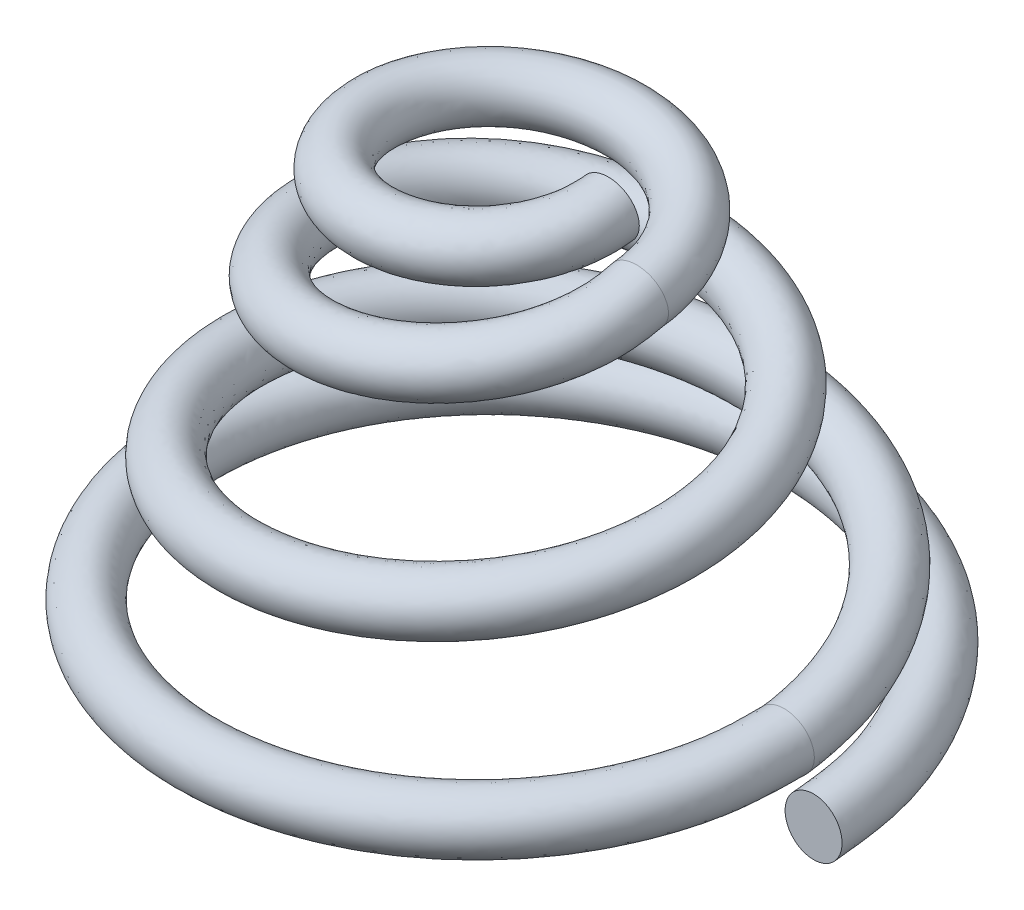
ISO-10303-21;
HEADER;
FILE_DESCRIPTION(('STEP AP214'),'2;1');
FILE_NAME('part.step','',(''),(''),'','','');
FILE_SCHEMA(('AUTOMOTIVE_DESIGN { 1 0 10303 214 1 1 1 1 }'));
ENDSEC;
DATA;
#1=APPLICATION_CONTEXT('core data for automotive mechanical design processes');
#2=APPLICATION_PROTOCOL_DEFINITION('international standard','automotive_design',2000,#1);
#3=PRODUCT_CONTEXT('',#1,'mechanical');
#4=PRODUCT('Part','Part','',(#3));
#5=PRODUCT_RELATED_PRODUCT_CATEGORY('part','',(#4));
#6=PRODUCT_DEFINITION_FORMATION('','',#4);
#7=PRODUCT_DEFINITION_CONTEXT('part definition',#1,'design');
#8=PRODUCT_DEFINITION('design','',#6,#7);
#9=PRODUCT_DEFINITION_SHAPE('','',#8);
#10=(LENGTH_UNIT() NAMED_UNIT(*) SI_UNIT(.MILLI.,.METRE.));
#11=(NAMED_UNIT(*) PLANE_ANGLE_UNIT() SI_UNIT($,.RADIAN.));
#12=(NAMED_UNIT(*) SI_UNIT($,.STERADIAN.) SOLID_ANGLE_UNIT());
#13=UNCERTAINTY_MEASURE_WITH_UNIT(LENGTH_MEASURE(1.E-05),#10,'distance_accuracy_value','');
#14=(GEOMETRIC_REPRESENTATION_CONTEXT(3) GLOBAL_UNCERTAINTY_ASSIGNED_CONTEXT((#13)) GLOBAL_UNIT_ASSIGNED_CONTEXT((#10,
#11,#12)) REPRESENTATION_CONTEXT('',''));
#15=CARTESIAN_POINT('',(0.,0.,0.));
#16=DIRECTION('',(0.,0.,1.));
#17=DIRECTION('',(1.,0.,0.));
#18=AXIS2_PLACEMENT_3D('',#15,#16,#17);
#19=CARTESIAN_POINT('',(4.398899,0.3683,0.));
#20=CARTESIAN_POINT('',(4.37858593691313,0.376513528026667,-0.287265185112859));
#21=CARTESIAN_POINT('',(4.33801680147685,0.392917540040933,-0.860989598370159));
#22=CARTESIAN_POINT('',(4.06711719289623,0.417447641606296,-1.68499491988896));
#23=CARTESIAN_POINT('',(3.65248660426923,0.442137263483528,-2.43963669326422));
#24=CARTESIAN_POINT('',(3.0979469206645,0.466653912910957,-3.09751031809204));
#25=CARTESIAN_POINT('',(2.42743155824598,0.491347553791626,-3.6321273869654));
#26=CARTESIAN_POINT('',(1.66794846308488,0.515862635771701,-4.02582016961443));
#27=CARTESIAN_POINT('',(0.848094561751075,0.540557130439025,-4.26174820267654));
#28=CARTESIAN_POINT('',(0.000345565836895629,0.565071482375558,-4.33439289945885));
#29=CARTESIAN_POINT('',(-0.842856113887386,0.589766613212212,-4.23905752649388));
#30=CARTESIAN_POINT('',(-1.64950135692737,0.614280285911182,-3.98306890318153));
#31=CARTESIAN_POINT('',(-2.38801029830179,0.638976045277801,-3.57445996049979));
#32=CARTESIAN_POINT('',(-3.03175647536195,0.663489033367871,-3.0321542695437));
#33=CARTESIAN_POINT('',(-3.55478539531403,0.68818542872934,-2.37555959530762));
#34=CARTESIAN_POINT('',(-3.93983746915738,0.712697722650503,-1.6322027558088));
#35=CARTESIAN_POINT('',(-4.17045845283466,0.737394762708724,-0.829799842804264));
#36=CARTESIAN_POINT('',(-4.24127189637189,0.761906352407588,-0.000214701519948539));
#37=CARTESIAN_POINT('',(-4.14771647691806,0.786604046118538,0.824822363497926));
#38=CARTESIAN_POINT('',(-3.89698533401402,0.811114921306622,1.61398847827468));
#39=CARTESIAN_POINT('',(-3.49697223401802,0.835813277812,2.33639573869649));
#40=CARTESIAN_POINT('',(-2.96621244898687,0.860323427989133,2.96600527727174));
#41=CARTESIAN_POINT('',(-2.32372094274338,0.885022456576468,3.47744738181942));
#42=CARTESIAN_POINT('',(-1.59644087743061,0.9095318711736,3.85385704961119));
#43=CARTESIAN_POINT('',(-0.811501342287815,0.934231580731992,4.07917002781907));
#44=CARTESIAN_POINT('',(-7.73115956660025E-05,0.958740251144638,4.14815063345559));
#45=CARTESIAN_POINT('',(0.80679754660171,0.983440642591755,4.05637494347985));
#46=CARTESIAN_POINT('',(1.57847177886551,1.00794859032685,3.81089613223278));
#47=CARTESIAN_POINT('',(2.2848238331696,1.03264955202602,3.41949214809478));
#48=CARTESIAN_POINT('',(2.90012093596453,1.05715721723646,2.90022353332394));
#49=CARTESIAN_POINT('',(3.40062541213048,1.08185708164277,2.27203371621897));
#50=CARTESIAN_POINT('',(3.76597614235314,1.10637068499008,1.5600889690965));
#51=CARTESIAN_POINT('',(3.99510160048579,1.13106239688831,0.794865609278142));
#52=CARTESIAN_POINT('',(4.01757524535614,1.14750773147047,0.25782199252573));
#53=CARTESIAN_POINT('',(4.02880582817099,1.15572583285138,-0.0105507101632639));
#54=CARTESIAN_POINT('',(4.398899,1.1049,0.));
#55=CARTESIAN_POINT('',(4.37855706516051,1.1131135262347,-0.287235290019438));
#56=CARTESIAN_POINT('',(4.33793026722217,1.12951753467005,-0.86089999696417));
#57=CARTESIAN_POINT('',(4.06721763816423,1.15404763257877,-1.68489554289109));
#58=CARTESIAN_POINT('',(3.6525079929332,1.17873723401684,-2.43940718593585));
#59=CARTESIAN_POINT('',(3.09818051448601,1.20325386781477,-3.09736812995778));
#60=CARTESIAN_POINT('',(2.42765371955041,1.22794747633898,-3.63185261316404));
#61=CARTESIAN_POINT('',(1.66834703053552,1.25246252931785,-4.02573254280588));
#62=CARTESIAN_POINT('',(0.848540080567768,1.27715697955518,-4.26155813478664));
#63=CARTESIAN_POINT('',(0.000884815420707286,1.30167128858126,-4.33447135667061));
#64=CARTESIAN_POINT('',(-0.842237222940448,1.32636636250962,-4.23908498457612));
#65=CARTESIAN_POINT('',(-1.64890735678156,1.35087997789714,-3.98340745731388));
#66=CARTESIAN_POINT('',(-2.38733588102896,1.37557566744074,-3.5748047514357));
#67=CARTESIAN_POINT('',(-3.03124278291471,1.40008858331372,-3.03279893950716));
#68=CARTESIAN_POINT('',(-3.55422050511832,1.42478489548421,-2.37625727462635));
#69=CARTESIAN_POINT('',(-3.93956181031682,1.44929710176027,-1.63312930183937));
#70=CARTESIAN_POINT('',(-4.17018152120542,1.47399404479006,-0.830802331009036));
#71=CARTESIAN_POINT('',(-4.24137921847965,1.49850553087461,-0.00132033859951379));
#72=CARTESIAN_POINT('',(-4.14787860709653,1.52320311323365,0.823649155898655));
#73=CARTESIAN_POINT('',(-3.89757040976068,1.54771386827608,1.61287620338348));
#74=CARTESIAN_POINT('',(-3.49765778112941,1.57241209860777,2.33525531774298));
#75=CARTESIAN_POINT('',(-2.96728849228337,1.59692211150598,2.9651026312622));
#76=CARTESIAN_POINT('',(-2.32491784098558,1.62162099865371,3.47657888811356));
#77=CARTESIAN_POINT('',(-1.59792152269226,1.64613025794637,3.85338505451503));
#78=CARTESIAN_POINT('',(-0.813088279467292,1.67082981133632,4.07880247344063));
#79=CARTESIAN_POINT('',(-0.00177719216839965,1.6953383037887,4.14829029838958));
#80=CARTESIAN_POINT('',(0.805042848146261,1.72003853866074,4.05667488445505));
#81=CARTESIAN_POINT('',(1.57681589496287,1.74454622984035,3.81175689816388));
#82=CARTESIAN_POINT('',(2.28319489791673,1.76924723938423,3.42047618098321));
#83=CARTESIAN_POINT('',(2.89881011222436,1.79375380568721,2.90197566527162));
#84=CARTESIAN_POINT('',(3.399440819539,1.81845675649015,2.27292843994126));
#85=CARTESIAN_POINT('',(3.76529169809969,1.84295788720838,1.5652234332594));
#86=CARTESIAN_POINT('',(3.99466653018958,1.86769487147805,0.785647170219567));
#87=CARTESIAN_POINT('',(4.01748190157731,1.88402700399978,0.284685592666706));
#88=CARTESIAN_POINT('',(4.02888325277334,1.89218853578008,0.0343438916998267));
#89=CARTESIAN_POINT('',(3.662299,1.1049,0.));
#90=CARTESIAN_POINT('',(3.64469120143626,1.11308095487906,-0.239044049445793));
#91=CARTESIAN_POINT('',(3.6095250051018,1.12941991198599,-0.71646148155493));
#92=CARTESIAN_POINT('',(3.3825812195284,1.15410791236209,-1.40132254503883));
#93=CARTESIAN_POINT('',(3.03594383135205,1.17863068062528,-2.0276318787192));
#94=CARTESIAN_POINT('',(2.57393183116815,1.20332462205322,-2.57321282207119));
#95=CARTESIAN_POINT('',(2.01573157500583,1.22784536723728,-3.01547153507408));
#96=CARTESIAN_POINT('',(1.38462745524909,1.25254031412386,-3.3408218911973));
#97=CARTESIAN_POINT('',(0.703920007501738,1.27706034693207,-3.53445049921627));
#98=CARTESIAN_POINT('',(0.000928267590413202,1.30175595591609,-3.59312098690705));
#99=CARTESIAN_POINT('',(-0.697533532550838,1.32627536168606,-3.51199405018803));
#100=CARTESIAN_POINT('',(-1.36510528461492,1.35097161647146,-3.29853024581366));
#101=CARTESIAN_POINT('',(-1.97534756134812,1.37549039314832,-2.95847200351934));
#102=CARTESIAN_POINT('',(-2.50690659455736,1.40018730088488,-2.50870734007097));
#103=CARTESIAN_POINT('',(-2.93769617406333,1.42470544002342,-1.96455565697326));
#104=CARTESIAN_POINT('',(-3.25455191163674,1.44940300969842,-1.3496475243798));
#105=CARTESIAN_POINT('',(-3.44302297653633,1.47392050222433,-0.686438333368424));
#106=CARTESIAN_POINT('',(-3.50002881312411,1.49861874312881,-0.00162603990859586));
#107=CARTESIAN_POINT('',(-3.42083909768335,1.52313557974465,0.678686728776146));
#108=CARTESIAN_POINT('',(-3.2127947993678,1.54783450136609,1.32882881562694));
#109=CARTESIAN_POINT('',(-2.88147333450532,1.57235067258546,1.92304502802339));
#110=CARTESIAN_POINT('',(-2.4433869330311,1.59705028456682,2.44057641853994));
#111=CARTESIAN_POINT('',(-1.9134408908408,1.62156578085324,2.85990444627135));
#112=CARTESIAN_POINT('',(-1.31469106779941,1.64626609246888,3.16827112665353));
#113=CARTESIAN_POINT('',(-0.668992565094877,1.67078090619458,3.35159046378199));
#114=CARTESIAN_POINT('',(-0.00235812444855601,1.69548191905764,3.40694049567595));
#115=CARTESIAN_POINT('',(0.659808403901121,1.71999607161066,3.32968743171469));
#116=CARTESIAN_POINT('',(1.29251282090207,1.7446976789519,3.12709554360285));
#117=CARTESIAN_POINT('',(1.8707448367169,1.76921159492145,2.80441966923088));
#118=CARTESIAN_POINT('',(2.37410958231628,1.79391219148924,2.37837724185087));
#119=CARTESIAN_POINT('',(2.78251533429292,1.81843186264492,1.86130304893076));
#120=CARTESIAN_POINT('',(3.080415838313,1.84310916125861,1.28368525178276));
#121=CARTESIAN_POINT('',(3.26608005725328,1.86773344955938,0.636614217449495));
#122=CARTESIAN_POINT('',(3.28357232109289,1.88400540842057,0.249096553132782));
#123=CARTESIAN_POINT('',(3.29231359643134,1.89213687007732,0.0554453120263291));
#124=CARTESIAN_POINT('',(3.662299,0.368300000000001,0.));
#125=CARTESIAN_POINT('',(3.64472007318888,0.376480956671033,-0.239073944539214));
#126=CARTESIAN_POINT('',(3.60961153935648,0.39281991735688,-0.716551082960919));
#127=CARTESIAN_POINT('',(3.3824807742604,0.417507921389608,-1.4014219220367));
#128=CARTESIAN_POINT('',(3.03592244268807,0.44203071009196,-2.02786138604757));
#129=CARTESIAN_POINT('',(2.57369823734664,0.466724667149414,-2.57335501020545));
#130=CARTESIAN_POINT('',(2.01550941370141,0.491245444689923,-3.01574630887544));
#131=CARTESIAN_POINT('',(1.38422888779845,0.51594042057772,-3.34090951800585));
#132=CARTESIAN_POINT('',(0.703474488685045,0.540460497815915,-3.53464056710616));
#133=CARTESIAN_POINT('',(0.000389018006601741,0.565156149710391,-3.59304252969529));
#134=CARTESIAN_POINT('',(-0.698152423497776,0.589675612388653,-3.51196659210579));
#135=CARTESIAN_POINT('',(-1.36569928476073,0.614371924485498,-3.2981916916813));
#136=CARTESIAN_POINT('',(-1.97602197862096,0.638890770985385,-2.95812721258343));
#137=CARTESIAN_POINT('',(-2.5074202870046,0.663587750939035,-2.50806267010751));
#138=CARTESIAN_POINT('',(-2.93826106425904,0.688105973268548,-1.96385797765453));
#139=CARTESIAN_POINT('',(-3.2548275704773,0.712803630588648,-1.34872097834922));
#140=CARTESIAN_POINT('',(-3.44329990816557,0.737321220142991,-0.685435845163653));
#141=CARTESIAN_POINT('',(-3.49992149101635,0.762019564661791,-0.000520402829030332));
#142=CARTESIAN_POINT('',(-3.42067696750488,0.786536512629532,0.679859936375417));
#143=CARTESIAN_POINT('',(-3.21220972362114,0.811235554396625,1.32994109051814));
#144=CARTESIAN_POINT('',(-2.88078778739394,0.835751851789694,1.9241854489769));
#145=CARTESIAN_POINT('',(-2.4423108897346,0.860451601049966,2.44147906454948));
#146=CARTESIAN_POINT('',(-1.9122439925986,0.884967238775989,2.86077293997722));
#147=CARTESIAN_POINT('',(-1.31321042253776,0.90966770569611,3.16874312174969));
#148=CARTESIAN_POINT('',(-0.6674056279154,0.934182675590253,3.35195801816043));
#149=CARTESIAN_POINT('',(-0.000658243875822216,0.958883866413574,3.40680083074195));
#150=CARTESIAN_POINT('',(0.661563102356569,0.983398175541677,3.32938749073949));
#151=CARTESIAN_POINT('',(1.29416870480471,1.0081000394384,3.12623477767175));
#152=CARTESIAN_POINT('',(1.87237377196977,1.03261390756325,2.80343563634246));
#153=CARTESIAN_POINT('',(2.37542040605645,1.05731560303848,2.37662510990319));
#154=CARTESIAN_POINT('',(2.78369992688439,1.08183218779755,1.86040832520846));
#155=CARTESIAN_POINT('',(3.08110028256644,1.10652195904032,1.27855078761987));
#156=CARTESIAN_POINT('',(3.26651512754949,1.13110097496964,0.645832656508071));
#157=CARTESIAN_POINT('',(3.28366566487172,1.14748613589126,0.222232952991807));
#158=CARTESIAN_POINT('',(3.29223617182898,1.15567416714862,0.0105507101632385));
#159=CARTESIAN_POINT('',(3.662299,-0.368299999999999,0.));
#160=CARTESIAN_POINT('',(3.64474894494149,-0.360119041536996,-0.239103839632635));
#161=CARTESIAN_POINT('',(3.60969807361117,-0.343780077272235,-0.716640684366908));
#162=CARTESIAN_POINT('',(3.38238032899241,-0.31909206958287,-1.40152129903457));
#163=CARTESIAN_POINT('',(3.0359010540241,-0.294569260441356,-2.02809089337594));
#164=CARTESIAN_POINT('',(2.57346464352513,-0.269875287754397,-2.57349719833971));
#165=CARTESIAN_POINT('',(2.01528725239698,-0.245354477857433,-3.0160210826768));
#166=CARTESIAN_POINT('',(1.3838303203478,-0.220659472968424,-3.3409971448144));
#167=CARTESIAN_POINT('',(0.703028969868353,-0.196139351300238,-3.53483063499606));
#168=CARTESIAN_POINT('',(-0.000150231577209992,-0.17144365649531,-3.59296407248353));
#169=CARTESIAN_POINT('',(-0.698771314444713,-0.146924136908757,-3.51193913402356));
#170=CARTESIAN_POINT('',(-1.36629328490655,-0.122227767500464,-3.29785313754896));
#171=CARTESIAN_POINT('',(-1.97669639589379,-0.0977088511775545,-2.95778242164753));
#172=CARTESIAN_POINT('',(-2.50793397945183,-0.0730117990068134,-2.50741800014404));
#173=CARTESIAN_POINT('',(-2.93882595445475,-0.0484934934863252,-1.96316029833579));
#174=CARTESIAN_POINT('',(-3.25510322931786,-0.0237957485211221,-1.34779443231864));
#175=CARTESIAN_POINT('',(-3.44357683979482,0.000721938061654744,-0.68443335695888));
#176=CARTESIAN_POINT('',(-3.49981416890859,0.0254203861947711,0.000585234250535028));
#177=CARTESIAN_POINT('',(-3.42051483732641,0.0499374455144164,0.681033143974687));
#178=CARTESIAN_POINT('',(-3.21162464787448,0.0746366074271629,1.33105336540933));
#179=CARTESIAN_POINT('',(-2.88010224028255,0.099153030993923,1.92532586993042));
#180=CARTESIAN_POINT('',(-2.4412348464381,0.123852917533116,2.44238171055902));
#181=CARTESIAN_POINT('',(-1.9110470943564,0.148368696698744,2.86164143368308));
#182=CARTESIAN_POINT('',(-1.31172977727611,0.173069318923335,3.16921511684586));
#183=CARTESIAN_POINT('',(-0.665818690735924,0.197584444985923,3.35232557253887));
#184=CARTESIAN_POINT('',(0.00104163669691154,0.22228581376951,3.40666116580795));
#185=CARTESIAN_POINT('',(0.663317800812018,0.246800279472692,3.3290875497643));
#186=CARTESIAN_POINT('',(1.29582458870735,0.271502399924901,3.12537401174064));
#187=CARTESIAN_POINT('',(1.87400270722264,0.296016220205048,2.80245160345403));
#188=CARTESIAN_POINT('',(2.37673122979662,0.320719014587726,2.3748729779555));
#189=CARTESIAN_POINT('',(2.78488451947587,0.345232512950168,1.85951360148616));
#190=CARTESIAN_POINT('',(3.08178472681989,0.36993475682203,1.27341632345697));
#191=CARTESIAN_POINT('',(3.2669501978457,0.394468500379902,0.655051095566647));
#192=CARTESIAN_POINT('',(3.28375900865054,0.410966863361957,0.195369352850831));
#193=CARTESIAN_POINT('',(3.29215874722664,0.419211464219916,-0.0343438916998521));
#194=CARTESIAN_POINT('',(4.398899,-0.3683,0.));
#195=CARTESIAN_POINT('',(4.37861480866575,-0.360086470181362,-0.28729508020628));
#196=CARTESIAN_POINT('',(4.33810333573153,-0.343682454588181,-0.861079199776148));
#197=CARTESIAN_POINT('',(4.06701674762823,-0.319152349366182,-1.68509429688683));
#198=CARTESIAN_POINT('',(3.65246521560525,-0.294462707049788,-2.43986620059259));
#199=CARTESIAN_POINT('',(3.09771332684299,-0.269946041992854,-3.0976525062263));
#200=CARTESIAN_POINT('',(2.42720939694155,-0.24525236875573,-3.63240216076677));
#201=CARTESIAN_POINT('',(1.66754989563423,-0.220737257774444,-4.02590779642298));
#202=CARTESIAN_POINT('',(0.847649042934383,-0.196042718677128,-4.26193827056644));
#203=CARTESIAN_POINT('',(-0.000193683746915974,-0.171528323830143,-4.33431444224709));
#204=CARTESIAN_POINT('',(-0.843475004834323,-0.146833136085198,-4.23903006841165));
#205=CARTESIAN_POINT('',(-1.65009535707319,-0.12231940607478,-3.98273034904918));
#206=CARTESIAN_POINT('',(-2.38868471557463,-0.0976235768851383,-3.57411516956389));
#207=CARTESIAN_POINT('',(-3.03227016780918,-0.073110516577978,-3.03150959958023));
#208=CARTESIAN_POINT('',(-3.55535028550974,-0.0484140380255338,-2.37486191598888));
#209=CARTESIAN_POINT('',(-3.94011312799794,-0.0239016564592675,-1.63127620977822));
#210=CARTESIAN_POINT('',(-4.1707353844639,0.000795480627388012,-0.828797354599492));
#211=CARTESIAN_POINT('',(-4.24116457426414,0.0253071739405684,0.000890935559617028));
#212=CARTESIAN_POINT('',(-4.14755434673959,0.0500049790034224,0.825995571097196));
#213=CARTESIAN_POINT('',(-3.89640025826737,0.0745159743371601,1.61510075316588));
#214=CARTESIAN_POINT('',(-3.49628668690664,0.0992144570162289,2.33753615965));
#215=CARTESIAN_POINT('',(-2.96513640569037,0.123724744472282,2.96690792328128));
#216=CARTESIAN_POINT('',(-2.32252404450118,0.148423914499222,3.47831587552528));
#217=CARTESIAN_POINT('',(-1.59496023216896,0.172933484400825,3.85432904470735));
#218=CARTESIAN_POINT('',(-0.809914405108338,0.197633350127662,4.07953758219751));
#219=CARTESIAN_POINT('',(0.00162256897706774,0.222142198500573,4.14801096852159));
#220=CARTESIAN_POINT('',(0.808552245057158,0.246842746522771,4.05607500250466));
#221=CARTESIAN_POINT('',(1.58012766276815,0.271350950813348,3.81003536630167));
#222=CARTESIAN_POINT('',(2.28645276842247,0.296051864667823,3.41850811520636));
#223=CARTESIAN_POINT('',(2.9014317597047,0.320560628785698,2.89847140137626));
#224=CARTESIAN_POINT('',(3.40181000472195,0.345257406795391,2.27113899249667));
#225=CARTESIAN_POINT('',(3.76666058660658,0.369783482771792,1.55495450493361));
#226=CARTESIAN_POINT('',(3.995536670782,0.394429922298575,0.804084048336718));
#227=CARTESIAN_POINT('',(4.01766858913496,0.410988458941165,0.230958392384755));
#228=CARTESIAN_POINT('',(4.02872840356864,0.419263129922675,-0.0554453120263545));
#229=CARTESIAN_POINT('',(4.398899,0.3683,0.));
#230=CARTESIAN_POINT('',(4.37858593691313,0.376513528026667,-0.287265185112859));
#231=CARTESIAN_POINT('',(4.33801680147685,0.392917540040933,-0.860989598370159));
#232=CARTESIAN_POINT('',(4.06711719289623,0.417447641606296,-1.68499491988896));
#233=CARTESIAN_POINT('',(3.65248660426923,0.442137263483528,-2.43963669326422));
#234=CARTESIAN_POINT('',(3.0979469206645,0.466653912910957,-3.09751031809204));
#235=CARTESIAN_POINT('',(2.42743155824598,0.491347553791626,-3.6321273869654));
#236=CARTESIAN_POINT('',(1.66794846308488,0.515862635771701,-4.02582016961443));
#237=CARTESIAN_POINT('',(0.848094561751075,0.540557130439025,-4.26174820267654));
#238=CARTESIAN_POINT('',(0.000345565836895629,0.565071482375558,-4.33439289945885));
#239=CARTESIAN_POINT('',(-0.842856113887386,0.589766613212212,-4.23905752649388));
#240=CARTESIAN_POINT('',(-1.64950135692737,0.614280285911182,-3.98306890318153));
#241=CARTESIAN_POINT('',(-2.38801029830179,0.638976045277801,-3.57445996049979));
#242=CARTESIAN_POINT('',(-3.03175647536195,0.663489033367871,-3.0321542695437));
#243=CARTESIAN_POINT('',(-3.55478539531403,0.68818542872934,-2.37555959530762));
#244=CARTESIAN_POINT('',(-3.93983746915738,0.712697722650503,-1.6322027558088));
#245=CARTESIAN_POINT('',(-4.17045845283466,0.737394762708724,-0.829799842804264));
#246=CARTESIAN_POINT('',(-4.24127189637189,0.761906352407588,-0.000214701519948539));
#247=CARTESIAN_POINT('',(-4.14771647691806,0.786604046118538,0.824822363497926));
#248=CARTESIAN_POINT('',(-3.89698533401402,0.811114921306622,1.61398847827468));
#249=CARTESIAN_POINT('',(-3.49697223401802,0.835813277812,2.33639573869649));
#250=CARTESIAN_POINT('',(-2.96621244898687,0.860323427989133,2.96600527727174));
#251=CARTESIAN_POINT('',(-2.32372094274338,0.885022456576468,3.47744738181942));
#252=CARTESIAN_POINT('',(-1.59644087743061,0.9095318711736,3.85385704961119));
#253=CARTESIAN_POINT('',(-0.811501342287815,0.934231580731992,4.07917002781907));
#254=CARTESIAN_POINT('',(-7.73115956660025E-05,0.958740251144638,4.14815063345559));
#255=CARTESIAN_POINT('',(0.80679754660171,0.983440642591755,4.05637494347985));
#256=CARTESIAN_POINT('',(1.57847177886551,1.00794859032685,3.81089613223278));
#257=CARTESIAN_POINT('',(2.2848238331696,1.03264955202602,3.41949214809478));
#258=CARTESIAN_POINT('',(2.90012093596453,1.05715721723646,2.90022353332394));
#259=CARTESIAN_POINT('',(3.40062541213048,1.08185708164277,2.27203371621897));
#260=CARTESIAN_POINT('',(3.76597614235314,1.10637068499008,1.5600889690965));
#261=CARTESIAN_POINT('',(3.99510160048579,1.13106239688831,0.794865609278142));
#262=CARTESIAN_POINT('',(4.01757524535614,1.14750773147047,0.25782199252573));
#263=CARTESIAN_POINT('',(4.02880582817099,1.15572583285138,-0.0105507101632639));
#264=(BOUNDED_SURFACE() B_SPLINE_SURFACE(3,3,((#19,#20,#21,#22,#23,#24,#25,#26,#27,#28,#29,#30,
#31,#32,#33,#34,#35,#36,#37,#38,#39,#40,#41,#42,#43,#44,#45,#46,#47,#48,#49,#50,#51,#52,#53),
(#54,#55,#56,#57,#58,#59,#60,#61,#62,#63,#64,#65,#66,#67,#68,#69,#70,#71,#72,#73,#74,#75,#76,
#77,#78,#79,#80,#81,#82,#83,#84,#85,#86,#87,#88),(#89,#90,#91,#92,#93,#94,#95,#96,#97,#98,#99,
#100,#101,#102,#103,#104,#105,#106,#107,#108,#109,#110,#111,#112,#113,#114,#115,#116,#117,#118,
#119,#120,#121,#122,#123),(#124,#125,#126,#127,#128,#129,#130,#131,#132,#133,#134,#135,#136,
#137,#138,#139,#140,#141,#142,#143,#144,#145,#146,#147,#148,#149,#150,#151,#152,#153,#154,#155,
#156,#157,#158),(#159,#160,#161,#162,#163,#164,#165,#166,#167,#168,#169,#170,#171,#172,#173,
#174,#175,#176,#177,#178,#179,#180,#181,#182,#183,#184,#185,#186,#187,#188,#189,#190,#191,#192,
#193),(#194,#195,#196,#197,#198,#199,#200,#201,#202,#203,#204,#205,#206,#207,#208,#209,#210,
#211,#212,#213,#214,#215,#216,#217,#218,#219,#220,#221,#222,#223,#224,#225,#226,#227,#228),
(#229,#230,#231,#232,#233,#234,#235,#236,#237,#238,#239,#240,#241,#242,#243,#244,#245,#246,#247,
#248,#249,#250,#251,#252,#253,#254,#255,#256,#257,#258,#259,#260,#261,#262,#263)),.UNSPECIFIED.,
.T.,.F.,.F.) B_SPLINE_SURFACE_WITH_KNOTS((4,3,4),(4,1,1,1,1,1,1,1,1,1,1,1,1,1,1,1,1,1,1,1,1,1,1,
1,1,1,1,1,1,1,1,1,4),(0.,0.5,1.),(0.,0.0326828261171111,0.0652739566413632,0.0977716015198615,
0.13017755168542,0.162490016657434,0.194710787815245,0.226838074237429,0.258873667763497,
0.29081577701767,0.322666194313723,0.35442312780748,0.386088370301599,0.417660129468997,
0.449140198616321,0.480526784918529,0.511821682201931,0.543023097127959,0.574132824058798,
0.605149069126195,0.63607362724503,0.666904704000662,0.697644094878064,0.728290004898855,
0.75884423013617,0.789304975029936,0.819674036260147,0.849949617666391,0.880133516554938,
0.910223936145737,0.940222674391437,0.970127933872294,1.),
.UNSPECIFIED.) GEOMETRIC_REPRESENTATION_ITEM() RATIONAL_B_SPLINE_SURFACE(((1.,1.,1.,1.,1.,1.,1.,
1.,1.,1.,1.,1.,1.,1.,1.,1.,1.,1.,1.,1.,1.,1.,1.,1.,1.,1.,1.,1.,1.,1.,1.,1.,1.,1.,1.),
(0.333333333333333,0.333333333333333,0.333333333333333,0.333333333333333,0.333333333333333,
0.333333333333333,0.333333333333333,0.333333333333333,0.333333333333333,0.333333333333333,
0.333333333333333,0.333333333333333,0.333333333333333,0.333333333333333,0.333333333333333,
0.333333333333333,0.333333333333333,0.333333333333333,0.333333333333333,0.333333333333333,
0.333333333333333,0.333333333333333,0.333333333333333,0.333333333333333,0.333333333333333,
0.333333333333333,0.333333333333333,0.333333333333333,0.333333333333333,0.333333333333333,
0.333333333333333,0.333333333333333,0.333333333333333,0.333333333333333,0.333333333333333),
(0.333333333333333,0.333333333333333,0.333333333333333,0.333333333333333,0.333333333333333,
0.333333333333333,0.333333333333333,0.333333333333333,0.333333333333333,0.333333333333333,
0.333333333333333,0.333333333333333,0.333333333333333,0.333333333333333,0.333333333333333,
0.333333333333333,0.333333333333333,0.333333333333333,0.333333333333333,0.333333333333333,
0.333333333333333,0.333333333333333,0.333333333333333,0.333333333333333,0.333333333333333,
0.333333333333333,0.333333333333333,0.333333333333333,0.333333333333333,0.333333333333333,
0.333333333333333,0.333333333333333,0.333333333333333,0.333333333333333,0.333333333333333),(1.,
1.,1.,1.,1.,1.,1.,1.,1.,1.,1.,1.,1.,1.,1.,1.,1.,1.,1.,1.,1.,1.,1.,1.,1.,1.,1.,1.,1.,1.,1.,1.,1.,
1.,1.),(0.333333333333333,0.333333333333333,0.333333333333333,0.333333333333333,
0.333333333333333,0.333333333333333,0.333333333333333,0.333333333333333,0.333333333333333,
0.333333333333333,0.333333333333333,0.333333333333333,0.333333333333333,0.333333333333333,
0.333333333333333,0.333333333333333,0.333333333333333,0.333333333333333,0.333333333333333,
0.333333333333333,0.333333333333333,0.333333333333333,0.333333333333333,0.333333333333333,
0.333333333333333,0.333333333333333,0.333333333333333,0.333333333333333,0.333333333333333,
0.333333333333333,0.333333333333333,0.333333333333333,0.333333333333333,0.333333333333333,
0.333333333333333),(0.333333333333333,0.333333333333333,0.333333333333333,0.333333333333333,
0.333333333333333,0.333333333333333,0.333333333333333,0.333333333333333,0.333333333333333,
0.333333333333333,0.333333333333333,0.333333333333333,0.333333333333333,0.333333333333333,
0.333333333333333,0.333333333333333,0.333333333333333,0.333333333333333,0.333333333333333,
0.333333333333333,0.333333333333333,0.333333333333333,0.333333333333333,0.333333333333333,
0.333333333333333,0.333333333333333,0.333333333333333,0.333333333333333,0.333333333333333,
0.333333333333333,0.333333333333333,0.333333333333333,0.333333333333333,0.333333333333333,
0.333333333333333),(1.,1.,1.,1.,1.,1.,1.,1.,1.,1.,1.,1.,1.,1.,1.,1.,1.,1.,1.,1.,1.,1.,1.,1.,1.,
1.,1.,1.,1.,1.,1.,1.,1.,1.,1.))) REPRESENTATION_ITEM('') SURFACE());
#265=CARTESIAN_POINT('',(4.030599,0.3683,0.));
#266=DIRECTION('',(0.,0.,1.));
#267=DIRECTION('',(1.,0.,0.));
#268=AXIS2_PLACEMENT_3D('',#265,#266,#267);
#269=CIRCLE('',#268,0.3683);
#270=CARTESIAN_POINT('',(4.398899,0.3683,0.));
#271=VERTEX_POINT('',#270);
#272=EDGE_CURVE('E11',#271,#271,#269,.T.);
#273=CARTESIAN_POINT('',(4.02880582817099,1.15572583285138,-0.0105507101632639));
#274=CARTESIAN_POINT('',(4.02888325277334,1.89218853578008,0.0343438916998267));
#275=CARTESIAN_POINT('',(3.29231359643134,1.89213687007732,0.0554453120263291));
#276=CARTESIAN_POINT('',(3.29223617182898,1.15567416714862,0.0105507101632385));
#277=CARTESIAN_POINT('',(3.29215874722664,0.419211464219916,-0.0343438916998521));
#278=CARTESIAN_POINT('',(4.02872840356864,0.419263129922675,-0.0554453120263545));
#279=CARTESIAN_POINT('',(4.02880582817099,1.15572583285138,-0.0105507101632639));
#280=(BOUNDED_CURVE() B_SPLINE_CURVE(3,(#273,#274,#275,#276,#277,#278,#279),.UNSPECIFIED.,.T.,
.F.) B_SPLINE_CURVE_WITH_KNOTS((4,3,4),(0.,0.5,1.),
.UNSPECIFIED.) CURVE() GEOMETRIC_REPRESENTATION_ITEM() RATIONAL_B_SPLINE_CURVE((1.,
0.333333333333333,0.333333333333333,1.,0.333333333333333,0.333333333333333,1.)) REPRESENTATION_ITEM(''));
#281=CARTESIAN_POINT('',(4.02880582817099,1.15572583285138,-0.0105507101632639));
#282=VERTEX_POINT('',#281);
#283=EDGE_CURVE('E63',#282,#282,#280,.F.);
#284=ORIENTED_EDGE('',*,*,#272,.F.);
#285=EDGE_LOOP('',(#284));
#286=FACE_BOUND('',#285,.T.);
#287=ORIENTED_EDGE('',*,*,#283,.F.);
#288=EDGE_LOOP('',(#287));
#289=FACE_BOUND('',#288,.T.);
#290=ADVANCED_FACE('F55',(#286,#289),#264,.F.);
#291=CARTESIAN_POINT('',(4.030599,0.3683,0.));
#292=DIRECTION('',(0.,0.,1.));
#293=DIRECTION('',(1.,0.,0.));
#294=AXIS2_PLACEMENT_3D('',#291,#292,#293);
#295=PLANE('',#294);
#296=ORIENTED_EDGE('',*,*,#272,.T.);
#297=EDGE_LOOP('',(#296));
#298=FACE_BOUND('',#297,.T.);
#299=ADVANCED_FACE('F106',(#298),#295,.T.);
#300=CARTESIAN_POINT('',(4.02880582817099,1.15572583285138,-0.0105507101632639));
#301=CARTESIAN_POINT('',(4.01897538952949,1.17664165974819,-0.248780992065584));
#302=CARTESIAN_POINT('',(3.94389445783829,1.21935678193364,-0.811902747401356));
#303=CARTESIAN_POINT('',(3.68577970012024,1.28186804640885,-1.53864391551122));
#304=CARTESIAN_POINT('',(3.2885142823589,1.34536707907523,-2.21557048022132));
#305=CARTESIAN_POINT('',(2.77254941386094,1.40806422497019,-2.79288422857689));
#306=CARTESIAN_POINT('',(2.15732407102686,1.47151408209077,-3.25511637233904));
#307=CARTESIAN_POINT('',(1.46950994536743,1.53421607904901,-3.58643815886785));
#308=CARTESIAN_POINT('',(0.735539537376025,1.59766975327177,-3.77435285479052));
#309=CARTESIAN_POINT('',(-0.0151065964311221,1.66036216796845,-3.81609590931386));
#310=CARTESIAN_POINT('',(-0.753461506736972,1.72382367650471,-3.7099123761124));
#311=CARTESIAN_POINT('',(-1.45172999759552,1.78650501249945,-3.46455464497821));
#312=CARTESIAN_POINT('',(-2.08290517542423,1.84997495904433,-3.08937052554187));
#313=CARTESIAN_POINT('',(-2.62503961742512,1.91264459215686,-2.6028422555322));
#314=CARTESIAN_POINT('',(-3.05713258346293,1.97612336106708,-2.02369005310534));
#315=CARTESIAN_POINT('',(-3.36623540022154,2.03878069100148,-1.37701436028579));
#316=CARTESIAN_POINT('',(-3.54036013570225,2.10226867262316,-0.687773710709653));
#317=CARTESIAN_POINT('',(-3.57724169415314,2.16491306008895,0.0163302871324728));
#318=CARTESIAN_POINT('',(-3.4754444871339,2.22841066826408,0.708091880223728));
#319=CARTESIAN_POINT('',(-3.24339248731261,2.29104142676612,1.36149637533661));
#320=CARTESIAN_POINT('',(-2.89008399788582,2.3545491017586,1.95130038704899));
#321=CARTESIAN_POINT('',(-2.43300899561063,2.41716549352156,2.45707215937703));
#322=CARTESIAN_POINT('',(-1.88989250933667,2.4806837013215,2.85930750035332));
#323=CARTESIAN_POINT('',(-1.2843378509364,2.54328494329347,3.14607827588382));
#324=CARTESIAN_POINT('',(-0.639811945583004,2.60681413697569,3.3063986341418));
#325=CARTESIAN_POINT('',(0.0177568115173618,2.66939954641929,3.33837382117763));
#326=CARTESIAN_POINT('',(0.662925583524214,2.73293961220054,3.24092304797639));
#327=CARTESIAN_POINT('',(1.27145321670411,2.79551064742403,3.02213661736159));
#328=CARTESIAN_POINT('',(1.81988430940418,2.85905338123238,2.6906574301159));
#329=CARTESIAN_POINT('',(2.30838460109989,2.9241982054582,2.24555234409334));
#330=CARTESIAN_POINT('',(2.70522090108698,2.99290166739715,1.6913559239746));
#331=CARTESIAN_POINT('',(2.97891135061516,3.06361588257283,1.04565815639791));
#332=CARTESIAN_POINT('',(3.10200061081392,3.13464374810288,0.363835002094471));
#333=CARTESIAN_POINT('',(3.07280116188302,3.20560778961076,-0.322350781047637));
#334=CARTESIAN_POINT('',(2.89582272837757,3.27643741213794,-0.976781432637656));
#335=CARTESIAN_POINT('',(2.58191840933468,3.34750222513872,-1.57088204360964));
#336=CARTESIAN_POINT('',(2.15098082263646,3.41828804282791,-2.07532848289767));
#337=CARTESIAN_POINT('',(1.62473141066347,3.48936710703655,-2.46815871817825));
#338=CARTESIAN_POINT('',(1.0320195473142,3.55998398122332,-2.73326679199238));
#339=CARTESIAN_POINT('',(0.40326805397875,3.6311538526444,-2.85938716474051));
#340=CARTESIAN_POINT('',(-0.231514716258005,3.70198362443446,-2.8447911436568));
#341=CARTESIAN_POINT('',(-0.838982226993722,3.7728679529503,-2.69284282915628));
#342=CARTESIAN_POINT('',(-1.39288519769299,3.84390276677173,-2.41369734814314));
#343=CARTESIAN_POINT('',(-1.86520535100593,3.9146150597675,-2.02530199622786));
#344=CARTESIAN_POINT('',(-2.23633275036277,3.9857985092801,-1.5472331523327));
#345=CARTESIAN_POINT('',(-2.4902960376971,4.05612491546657,-1.00665826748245));
#346=CARTESIAN_POINT('',(-2.61691969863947,4.12756000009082,-0.430577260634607));
#347=CARTESIAN_POINT('',(-2.61424101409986,4.19814840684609,0.152459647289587));
#348=CARTESIAN_POINT('',(-2.48482039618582,4.26917459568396,0.712263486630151));
#349=CARTESIAN_POINT('',(-2.23817508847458,4.34008545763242,1.22452825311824));
#350=CARTESIAN_POINT('',(-1.89030748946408,4.41082488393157,1.66298832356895));
#351=CARTESIAN_POINT('',(-1.45898764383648,4.48189612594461,2.01018827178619));
#352=CARTESIAN_POINT('',(-0.969553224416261,4.55253029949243,2.25048651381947));
#353=CARTESIAN_POINT('',(-0.445659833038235,4.62365271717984,2.37506409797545));
#354=CARTESIAN_POINT('',(0.0854176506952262,4.69404807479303,2.38157601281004));
#355=CARTESIAN_POINT('',(0.596952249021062,4.76527708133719,2.27211831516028));
#356=CARTESIAN_POINT('',(1.06621713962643,4.83597280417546,2.05567473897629));
#357=CARTESIAN_POINT('',(1.46914738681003,4.90676628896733,1.74599135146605));
#358=CARTESIAN_POINT('',(1.79027406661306,4.97782672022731,1.36075026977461));
#359=CARTESIAN_POINT('',(2.01420469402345,5.04811997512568,0.918017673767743));
#360=CARTESIAN_POINT('',(2.1348783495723,5.12009034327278,0.458006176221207));
#361=CARTESIAN_POINT('',(2.14139773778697,5.16504918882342,0.108273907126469));
#362=CARTESIAN_POINT('',(2.13018860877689,5.18889839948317,-0.0225094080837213));
#363=CARTESIAN_POINT('',(4.02872840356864,0.419263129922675,-0.0554453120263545));
#364=CARTESIAN_POINT('',(4.02204651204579,0.433479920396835,-0.21737388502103));
#365=CARTESIAN_POINT('',(3.92693952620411,0.488539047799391,-0.920168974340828));
#366=CARTESIAN_POINT('',(3.66042776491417,0.546189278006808,-1.58740416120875));
#367=CARTESIAN_POINT('',(3.25079496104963,0.611036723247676,-2.27362330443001));
#368=CARTESIAN_POINT('',(2.72423945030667,0.673437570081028,-2.83846371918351));
#369=CARTESIAN_POINT('',(2.1006495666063,0.737030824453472,-3.29223930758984));
#370=CARTESIAN_POINT('',(1.40594683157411,0.799758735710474,-3.61097684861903));
#371=CARTESIAN_POINT('',(0.667913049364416,0.863273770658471,-3.7868210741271));
#372=CARTESIAN_POINT('',(-0.0844091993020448,0.926017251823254,-3.81427714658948));
#373=CARTESIAN_POINT('',(-0.821825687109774,0.98953693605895,-3.69511349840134));
#374=CARTESIAN_POINT('',(-1.51608738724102,1.05227386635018,-3.43569075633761));
#375=CARTESIAN_POINT('',(-2.14130250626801,1.11580450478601,-3.04868122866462));
#376=CARTESIAN_POINT('',(-2.67416526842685,1.1785330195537,-2.55050190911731));
#377=CARTESIAN_POINT('',(-3.09603340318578,1.24207558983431,-1.9625741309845));
#378=CARTESIAN_POINT('',(-3.39185542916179,1.30479522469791,-1.30857439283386));
#379=CARTESIAN_POINT('',(-3.55293881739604,1.36835037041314,-0.615090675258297));
#380=CARTESIAN_POINT('',(-3.57445906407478,1.43106073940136,0.0906988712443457));
#381=CARTESIAN_POINT('',(-3.45874385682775,1.49462912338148,0.781341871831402));
#382=CARTESIAN_POINT('',(-3.21157746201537,1.55732982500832,1.4303111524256));
#383=CARTESIAN_POINT('',(-2.84562243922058,1.62091215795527,2.01361168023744));
#384=CARTESIAN_POINT('',(-2.37606020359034,1.68360276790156,2.50928165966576));
#385=CARTESIAN_POINT('',(-1.82359903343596,1.74719981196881,2.9004449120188));
#386=CARTESIAN_POINT('',(-1.21024961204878,1.80987989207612,3.17280454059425));
#387=CARTESIAN_POINT('',(-0.561273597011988,1.87349242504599,3.31904497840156));
#388=CARTESIAN_POINT('',(0.097981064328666,1.9361616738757,3.33438571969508));
#389=CARTESIAN_POINT('',(0.741813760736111,1.99978993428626,3.22193809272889));
#390=CARTESIAN_POINT('',(1.34540182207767,2.06245024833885,2.98681679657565));
#391=CARTESIAN_POINT('',(1.88667219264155,2.12608635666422,2.64173290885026));
#392=CARTESIAN_POINT('',(2.36371150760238,2.1913305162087,2.1826588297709));
#393=CARTESIAN_POINT('',(2.74712381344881,2.26014027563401,1.61770312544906));
#394=CARTESIAN_POINT('',(3.00331416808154,2.33097280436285,0.963382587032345));
#395=CARTESIAN_POINT('',(3.1080265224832,2.4021160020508,0.27727093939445));
#396=CARTESIAN_POINT('',(3.05925975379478,2.47320826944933,-0.409201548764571));
#397=CARTESIAN_POINT('',(2.86304989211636,2.54416219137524,-1.05944529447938));
#398=CARTESIAN_POINT('',(2.53110953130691,2.61536332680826,-1.64526148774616));
#399=CARTESIAN_POINT('',(2.08408932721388,2.68628552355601,-2.13728177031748));
#400=CARTESIAN_POINT('',(1.54487236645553,2.75750834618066,-2.5146010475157));
#401=CARTESIAN_POINT('',(0.94254477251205,2.82827735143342,-2.76064917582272));
#402=CARTESIAN_POINT('',(0.308828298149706,2.89959802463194,-2.86700278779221));
#403=CARTESIAN_POINT('',(-0.326577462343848,2.97059503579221,-2.83080425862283));
#404=CARTESIAN_POINT('',(-0.929781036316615,3.04164153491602,-2.65788366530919));
#405=CARTESIAN_POINT('',(-1.47488228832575,3.1128564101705,-2.35875638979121));
#406=CARTESIAN_POINT('',(-1.93376676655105,3.18374721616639,-1.95252161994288));
#407=CARTESIAN_POINT('',(-2.28818409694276,3.25512223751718,-1.45999958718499));
#408=CARTESIAN_POINT('',(-2.52095198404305,3.32564882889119,-0.908452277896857));
#409=CARTESIAN_POINT('',(-2.62628007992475,3.39728633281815,-0.326681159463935));
#410=CARTESIAN_POINT('',(-2.5994302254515,3.46809810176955,0.257360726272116));
#411=CARTESIAN_POINT('',(-2.44705175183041,3.53934179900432,0.812808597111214));
#412=CARTESIAN_POINT('',(-2.17797792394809,3.61049669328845,1.31554740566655));
#413=CARTESIAN_POINT('',(-1.81026959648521,3.6814762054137,1.73947500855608));
#414=CARTESIAN_POINT('',(-1.36254145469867,3.75281070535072,2.06808764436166));
#415=CARTESIAN_POINT('',(-0.860942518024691,3.82371344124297,2.28581314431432));
#416=CARTESIAN_POINT('',(-0.330090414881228,3.8951186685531,2.38600880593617));
#417=CARTESIAN_POINT('',(0.202300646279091,3.96581938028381,2.36541817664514));
#418=CARTESIAN_POINT('',(0.709364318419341,4.03735512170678,2.23057101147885));
#419=CARTESIAN_POINT('',(1.1681617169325,4.1083727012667,1.98870836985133));
#420=CARTESIAN_POINT('',(1.55500745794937,4.17957118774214,1.65642855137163));
#421=CARTESIAN_POINT('',(1.85592735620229,4.25074699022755,1.25375898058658));
#422=CARTESIAN_POINT('',(2.05253608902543,4.32235604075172,0.792180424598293));
#423=CARTESIAN_POINT('',(2.15331241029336,4.39132243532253,0.341939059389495));
#424=CARTESIAN_POINT('',(2.12106510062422,4.44488399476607,-0.0526576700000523));
#425=CARTESIAN_POINT('',(2.11579208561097,4.45610317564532,-0.114180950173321));
#426=CARTESIAN_POINT('',(3.29215874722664,0.419211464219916,-0.0343438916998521));
#427=CARTESIAN_POINT('',(3.28547685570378,0.433428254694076,-0.196272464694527));
#428=CARTESIAN_POINT('',(3.20715454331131,0.486898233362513,-0.719786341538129));
#429=CARTESIAN_POINT('',(2.98723543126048,0.545750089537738,-1.28269813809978));
#430=CARTESIAN_POINT('',(2.65182137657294,0.609819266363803,-1.8346522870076));
#431=CARTESIAN_POINT('',(2.22218604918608,0.673009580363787,-2.29314552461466));
#432=CARTESIAN_POINT('',(1.7149354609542,0.735923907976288,-2.65873644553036));
#433=CARTESIAN_POINT('',(1.15150187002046,0.799430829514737,-2.91444715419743));
#434=CARTESIAN_POINT('',(0.55447412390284,0.862259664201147,-3.05395841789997));
#435=CARTESIAN_POINT('',(-0.0523656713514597,0.925800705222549,-3.07339024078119));
#436=CARTESIAN_POINT('',(-0.645631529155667,0.988618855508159,-2.97476592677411));
#437=CARTESIAN_POINT('',(-1.20243456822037,1.05217486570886,-2.763703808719));
#438=CARTESIAN_POINT('',(-1.70238427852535,1.11498744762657,-2.45093867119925));
#439=CARTESIAN_POINT('',(-2.12682583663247,1.17855777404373,-2.05013667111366));
#440=CARTESIAN_POINT('',(-2.46146537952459,1.24136502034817,-1.57881635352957));
#441=CARTESIAN_POINT('',(-2.69448653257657,1.30495035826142,-1.05633731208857));
#442=CARTESIAN_POINT('',(-2.81972137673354,1.36775215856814,-0.504004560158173));
#443=CARTESIAN_POINT('',(-2.83367614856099,1.43135335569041,0.0562212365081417));
#444=CARTESIAN_POINT('',(-2.73898445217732,1.4941495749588,0.602748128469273));
#445=CARTESIAN_POINT('',(-2.54066118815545,1.55776755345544,1.11436728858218));
#446=CARTESIAN_POINT('',(-2.24939868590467,1.62055805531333,1.57262641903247));
#447=CARTESIAN_POINT('',(-1.8776349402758,1.68419381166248,1.96017093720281));
#448=CARTESIAN_POINT('',(-1.44212226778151,1.74697846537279,2.26449857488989));
#449=CARTESIAN_POINT('',(-0.960581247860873,1.81063306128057,2.4745086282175));
#450=CARTESIAN_POINT('',(-0.452927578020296,1.87341180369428,2.58541354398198));
#451=CARTESIAN_POINT('',(0.0606653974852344,1.93708615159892,2.59373750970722));
#452=CARTESIAN_POINT('',(0.560421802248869,1.99985980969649,2.5028734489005));
#453=CARTESIAN_POINT('',(1.02678138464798,2.06355166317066,2.31716771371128));
#454=CARTESIAN_POINT('',(1.44327843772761,2.12633305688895,2.04728036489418));
#455=CARTESIAN_POINT('',(1.80810782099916,2.19259703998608,1.69059713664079));
#456=CARTESIAN_POINT('',(2.09955229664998,2.26069739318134,1.25357960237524));
#457=CARTESIAN_POINT('',(2.29132945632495,2.33203566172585,0.751587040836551));
#458=CARTESIAN_POINT('',(2.36694096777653,2.40312873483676,0.225492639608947));
#459=CARTESIAN_POINT('',(2.325216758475,2.47423866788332,-0.295067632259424));
#460=CARTESIAN_POINT('',(2.17137932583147,2.54552416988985,-0.788503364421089));
#461=CARTESIAN_POINT('',(1.91672715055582,2.61655904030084,-1.22757748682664));
#462=CARTESIAN_POINT('',(1.57583661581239,2.68787824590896,-1.59558543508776));
#463=CARTESIAN_POINT('',(1.16843778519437,2.75893058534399,-1.8740698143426));
#464=CARTESIAN_POINT('',(0.716664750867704,2.83040638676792,-2.05302466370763));
#465=CARTESIAN_POINT('',(0.242930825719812,2.90139546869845,-2.12700768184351));
#466=CARTESIAN_POINT('',(-0.226579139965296,2.97266736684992,-2.09472172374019));
#467=CARTESIAN_POINT('',(-0.672074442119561,3.04394637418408,-1.96114049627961));
#468=CARTESIAN_POINT('',(-1.06872083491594,3.11504027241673,-1.73671890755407));
#469=CARTESIAN_POINT('',(-1.40187293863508,3.18648586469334,-1.43398749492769));
#470=CARTESIAN_POINT('',(-1.65457703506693,3.25747056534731,-1.07202585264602));
#471=CARTESIAN_POINT('',(-1.81772263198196,3.32928609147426,-0.669241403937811));
#472=CARTESIAN_POINT('',(-1.88755125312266,3.40006242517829,-0.247602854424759));
#473=CARTESIAN_POINT('',(-1.86166503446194,3.47162058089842,0.170781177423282));
#474=CARTESIAN_POINT('',(-1.74582879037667,3.54282382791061,0.5674581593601));
#475=CARTESIAN_POINT('',(-1.54895489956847,3.6140882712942,0.920329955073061));
#476=CARTESIAN_POINT('',(-1.28242691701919,3.68558198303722,1.21677088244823));
#477=CARTESIAN_POINT('',(-0.964035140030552,3.75672947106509,1.44107815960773));
#478=CARTESIAN_POINT('',(-0.609376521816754,3.8283254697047,1.58689287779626));
#479=CARTESIAN_POINT('',(-0.23906562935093,3.89947698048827,1.64863504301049));
#480=CARTESIAN_POINT('',(0.128083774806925,3.97130525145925,1.62631510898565));
#481=CARTESIAN_POINT('',(0.475156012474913,4.04240575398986,1.52554434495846));
#482=CARTESIAN_POINT('',(0.78295969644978,4.11394123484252,1.35342322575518));
#483=CARTESIAN_POINT('',(1.04058311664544,4.18556694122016,1.12085702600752));
#484=CARTESIAN_POINT('',(1.23483438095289,4.25653682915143,0.844666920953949));
#485=CARTESIAN_POINT('',(1.35791710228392,4.3296032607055,0.534694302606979));
#486=CARTESIAN_POINT('',(1.4158562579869,4.39617563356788,0.223323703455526));
#487=CARTESIAN_POINT('',(1.3854458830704,4.45568719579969,-0.0076388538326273));
#488=CARTESIAN_POINT('',(1.38017286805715,4.46690637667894,-0.0691621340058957));
#489=CARTESIAN_POINT('',(3.29223617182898,1.15567416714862,0.0105507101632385));
#490=CARTESIAN_POINT('',(3.2839800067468,1.17324047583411,-0.189528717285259));
#491=CARTESIAN_POINT('',(3.22338524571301,1.21925688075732,-0.629071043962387));
#492=CARTESIAN_POINT('',(3.01277901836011,1.28102108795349,-1.22929341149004));
#493=CARTESIAN_POINT('',(2.68948996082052,1.34425757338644,-1.77782902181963));
#494=CARTESIAN_POINT('',(2.27050944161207,1.40760766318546,-2.24724059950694));
#495=CARTESIAN_POINT('',(1.77160641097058,1.47041472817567,-2.62169964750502));
#496=CARTESIAN_POINT('',(1.21506592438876,1.53388617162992,-2.88988567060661));
#497=CARTESIAN_POINT('',(0.622100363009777,1.59665617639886,-3.04149623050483));
#498=CARTESIAN_POINT('',(0.0169369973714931,1.66014548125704,-3.07520740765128));
#499=CARTESIAN_POINT('',(-0.577267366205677,1.72290563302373,-2.9895652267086));
#500=CARTESIAN_POINT('',(-1.13807717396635,1.78640600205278,-2.79256758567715));
#501=CARTESIAN_POINT('',(-1.6439869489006,1.84915790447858,-2.49162799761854));
#502=CARTESIAN_POINT('',(-2.07770018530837,1.91266934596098,-2.10247700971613));
#503=CARTESIAN_POINT('',(-2.422564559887,1.97541279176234,-1.63993227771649));
#504=CARTESIAN_POINT('',(-2.66886650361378,2.03893582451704,-1.12477727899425));
#505=CARTESIAN_POINT('',(-2.80714269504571,2.10167046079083,-0.576687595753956));
#506=CARTESIAN_POINT('',(-2.83645877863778,2.16520567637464,-0.018147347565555));
#507=CARTESIAN_POINT('',(-2.75568508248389,2.22793111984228,0.529498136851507));
#508=CARTESIAN_POINT('',(-2.57247621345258,2.291479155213,1.04555251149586));
#509=CARTESIAN_POINT('',(-2.29386024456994,2.35419499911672,1.5103151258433));
#510=CARTESIAN_POINT('',(-1.93458373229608,2.41775653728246,1.90796143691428));
#511=CARTESIAN_POINT('',(-1.50841574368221,2.48046235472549,2.22336116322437));
#512=CARTESIAN_POINT('',(-1.03466948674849,2.54403811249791,2.44778236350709));
#513=CARTESIAN_POINT('',(-0.531465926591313,2.60673351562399,2.57276719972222));
#514=CARTESIAN_POINT('',(-0.0195588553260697,2.6703240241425,2.59772561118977));
#515=CARTESIAN_POINT('',(0.481533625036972,2.73300948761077,2.52185840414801));
#516=CARTESIAN_POINT('',(0.952832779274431,2.79661206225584,2.35248753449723));
#517=CARTESIAN_POINT('',(1.37649055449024,2.85930008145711,2.09620488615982));
#518=CARTESIAN_POINT('',(1.75278091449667,2.92546472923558,1.75349065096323));
#519=CARTESIAN_POINT('',(2.05764938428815,2.99345878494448,1.32723240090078));
#520=CARTESIAN_POINT('',(2.26692663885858,3.06467873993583,0.833862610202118));
#521=CARTESIAN_POINT('',(2.36091505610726,3.13565648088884,0.312056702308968));
#522=CARTESIAN_POINT('',(2.33875816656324,3.20663818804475,-0.20821686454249));
#523=CARTESIAN_POINT('',(2.20415216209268,3.27779939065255,-0.705839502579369));
#524=CARTESIAN_POINT('',(1.96753602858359,3.34869793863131,-1.15319804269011));
#525=CARTESIAN_POINT('',(1.64272811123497,3.41988076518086,-1.53363214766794));
#526=CARTESIAN_POINT('',(1.24829682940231,3.49078934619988,-1.82762748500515));
#527=CARTESIAN_POINT('',(0.806139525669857,3.56211301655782,-2.02564227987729));
#528=CARTESIAN_POINT('',(0.337370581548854,3.63295129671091,-2.11939205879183));
#529=CARTESIAN_POINT('',(-0.131516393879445,3.70405595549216,-2.10870860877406));
#530=CARTESIAN_POINT('',(-0.581275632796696,3.77517279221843,-1.99609966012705));
#531=CARTESIAN_POINT('',(-0.986723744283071,3.84608662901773,-1.79165986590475));
#532=CARTESIAN_POINT('',(-1.33331152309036,3.91735370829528,-1.50676787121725));
#533=CARTESIAN_POINT('',(-1.6027256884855,3.98814683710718,-1.15925941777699));
#534=CARTESIAN_POINT('',(-1.78706668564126,4.0597621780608,-0.767447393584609));
#535=CARTESIAN_POINT('',(-1.87819087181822,4.13033609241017,-0.351498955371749));
#536=CARTESIAN_POINT('',(-1.87647582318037,4.20167088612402,0.0658800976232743));
#537=CARTESIAN_POINT('',(-1.78359743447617,4.27265662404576,0.466913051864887));
#538=CARTESIAN_POINT('',(-1.60915206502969,4.34367703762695,0.829310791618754));
#539=CARTESIAN_POINT('',(-1.36246480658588,4.41493065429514,1.14028423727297));
#540=CARTESIAN_POINT('',(-1.06048134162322,4.48581491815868,1.38317864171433));
#541=CARTESIAN_POINT('',(-0.717987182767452,4.55714223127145,1.55156677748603));
#542=CARTESIAN_POINT('',(-0.354635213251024,4.62801138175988,1.63768840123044));
#543=CARTESIAN_POINT('',(0.011201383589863,4.69953266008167,1.6424799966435));
#544=CARTESIAN_POINT('',(0.362741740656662,4.77033239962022,1.56706595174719));
#545=CARTESIAN_POINT('',(0.681023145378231,4.84152426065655,1.42048324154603));
#546=CARTESIAN_POINT('',(0.954693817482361,4.9128242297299,1.21007880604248));
#547=CARTESIAN_POINT('',(1.16928752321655,4.98339010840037,0.952900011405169));
#548=CARTESIAN_POINT('',(1.31919839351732,5.05619126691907,0.656012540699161));
#549=CARTESIAN_POINT('',(1.3988290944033,5.12195014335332,0.355805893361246));
#550=CARTESIAN_POINT('',(1.40281046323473,5.18216740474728,0.118662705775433));
#551=CARTESIAN_POINT('',(1.39456939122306,5.19970160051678,0.0225094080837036));
#552=CARTESIAN_POINT('',(3.29231359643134,1.89213687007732,0.0554453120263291));
#553=CARTESIAN_POINT('',(3.28248315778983,1.91305269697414,-0.182784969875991));
#554=CARTESIAN_POINT('',(3.23961594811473,1.95161552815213,-0.538355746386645));
#555=CARTESIAN_POINT('',(3.03832260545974,2.01629208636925,-1.1758886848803));
#556=CARTESIAN_POINT('',(2.72715854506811,2.07869588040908,-1.72100575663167));
#557=CARTESIAN_POINT('',(2.31883283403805,2.14220574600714,-2.20133567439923));
#558=CARTESIAN_POINT('',(1.82827736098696,2.20490554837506,-2.58466284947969));
#559=CARTESIAN_POINT('',(1.27862997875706,2.2683415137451,-2.86532418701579));
#560=CARTESIAN_POINT('',(0.689726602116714,2.33105268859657,-3.02903404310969));
#561=CARTESIAN_POINT('',(0.0862396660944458,2.39449025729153,-3.07702457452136));
#562=CARTESIAN_POINT('',(-0.508903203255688,2.4571924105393,-3.00436452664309));
#563=CARTESIAN_POINT('',(-1.07371977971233,2.5206371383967,-2.82143136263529));
#564=CARTESIAN_POINT('',(-1.58558961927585,2.58332836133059,-2.53231732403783));
#565=CARTESIAN_POINT('',(-2.02857453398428,2.64678091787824,-2.15481734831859));
#566=CARTESIAN_POINT('',(-2.3836637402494,2.7094605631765,-1.7010482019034));
#567=CARTESIAN_POINT('',(-2.64324647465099,2.77292129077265,-1.19321724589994));
#568=CARTESIAN_POINT('',(-2.79456401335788,2.83558876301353,-0.649370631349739));
#569=CARTESIAN_POINT('',(-2.83924140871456,2.89905799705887,-0.0925159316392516));
#570=CARTESIAN_POINT('',(-2.77238571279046,2.96171266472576,0.456248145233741));
#571=CARTESIAN_POINT('',(-2.60429123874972,3.02519075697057,0.976737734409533));
#572=CARTESIAN_POINT('',(-2.33832180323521,3.08783194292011,1.44800383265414));
#573=CARTESIAN_POINT('',(-1.99153252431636,3.15131926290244,1.85575193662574));
#574=CARTESIAN_POINT('',(-1.57470921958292,3.21394624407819,2.18222375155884));
#575=CARTESIAN_POINT('',(-1.10875772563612,3.27744316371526,2.42105609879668));
#576=CARTESIAN_POINT('',(-0.610004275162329,3.34005522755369,2.56012085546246));
#577=CARTESIAN_POINT('',(-0.0997831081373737,3.40356189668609,2.60171371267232));
#578=CARTESIAN_POINT('',(0.402645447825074,3.46615916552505,2.54084335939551));
#579=CARTESIAN_POINT('',(0.878884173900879,3.52967246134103,2.38780735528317));
#580=CARTESIAN_POINT('',(1.30970267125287,3.59226710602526,2.14512940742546));
#581=CARTESIAN_POINT('',(1.69745400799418,3.65833241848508,1.81638416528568));
#582=CARTESIAN_POINT('',(2.01574647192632,3.72622017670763,1.40088519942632));
#583=CARTESIAN_POINT('',(2.24252382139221,3.79732181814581,0.916138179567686));
#584=CARTESIAN_POINT('',(2.35488914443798,3.86818422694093,0.39862076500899));
#585=CARTESIAN_POINT('',(2.35229957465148,3.93903770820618,-0.121366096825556));
#586=CARTESIAN_POINT('',(2.23692499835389,4.01007461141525,-0.623175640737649));
#587=CARTESIAN_POINT('',(2.01834490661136,4.08083683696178,-1.07881859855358));
#588=CARTESIAN_POINT('',(1.70961960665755,4.15188328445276,-1.47167886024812));
#589=CARTESIAN_POINT('',(1.32815587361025,4.22264810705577,-1.78118515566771));
#590=CARTESIAN_POINT('',(0.895614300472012,4.29381964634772,-1.99825989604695));
#591=CARTESIAN_POINT('',(0.431810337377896,4.36450712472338,-2.11177643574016));
#592=CARTESIAN_POINT('',(-0.0364536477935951,4.43544454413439,-2.12269549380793));
#593=CARTESIAN_POINT('',(-0.490476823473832,4.50639921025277,-2.03105882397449));
#594=CARTESIAN_POINT('',(-0.904726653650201,4.57713298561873,-1.84660082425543));
#595=CARTESIAN_POINT('',(-1.26475010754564,4.64822155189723,-1.57954824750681));
#596=CARTESIAN_POINT('',(-1.55087434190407,4.71882310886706,-1.24649298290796));
#597=CARTESIAN_POINT('',(-1.75641073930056,4.79023826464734,-0.865653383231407));
#598=CARTESIAN_POINT('',(-1.86883049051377,4.86060975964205,-0.45539505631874));
#599=CARTESIAN_POINT('',(-1.8912866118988,4.93172119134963,-0.0390209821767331));
#600=CARTESIAN_POINT('',(-1.82136607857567,5.0024894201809,0.366367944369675));
#601=CARTESIAN_POINT('',(-1.66934923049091,5.0732658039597,0.738291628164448));
#602=CARTESIAN_POINT('',(-1.44250269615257,5.14427932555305,1.0637975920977));
#603=CARTESIAN_POINT('',(-1.15692754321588,5.21490036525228,1.32527912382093));
#604=CARTESIAN_POINT('',(-0.826597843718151,5.2859589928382,1.5162406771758));
#605=CARTESIAN_POINT('',(-0.470204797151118,5.35654578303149,1.62674175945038));
#606=CARTESIAN_POINT('',(-0.105681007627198,5.42776006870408,1.65864488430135));
#607=CARTESIAN_POINT('',(0.250327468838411,5.49825904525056,1.60858755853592));
#608=CARTESIAN_POINT('',(0.579086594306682,5.56910728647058,1.48754325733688));
#609=CARTESIAN_POINT('',(0.868804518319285,5.64008151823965,1.29930058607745));
#610=CARTESIAN_POINT('',(1.10374066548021,5.71024338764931,1.06113310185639));
#611=CARTESIAN_POINT('',(1.28047968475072,5.78277927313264,0.777330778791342));
#612=CARTESIAN_POINT('',(1.38180193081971,5.84772465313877,0.488288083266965));
#613=CARTESIAN_POINT('',(1.42017504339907,5.90864761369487,0.244964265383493));
#614=CARTESIAN_POINT('',(1.40896591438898,5.93249682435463,0.114180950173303));
#615=CARTESIAN_POINT('',(4.02888325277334,1.89218853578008,0.0343438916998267));
#616=CARTESIAN_POINT('',(4.01590426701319,1.91980339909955,-0.280188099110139));
#617=CARTESIAN_POINT('',(3.96084938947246,1.95017451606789,-0.703636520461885));
#618=CARTESIAN_POINT('',(3.71113163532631,2.0175468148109,-1.48988366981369));
#619=CARTESIAN_POINT('',(3.32623360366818,2.07969743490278,-2.15751765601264));
#620=CARTESIAN_POINT('',(2.82085937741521,2.14269087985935,-2.74730473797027));
#621=CARTESIAN_POINT('',(2.21399857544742,2.20599733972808,-3.21799343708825));
#622=CARTESIAN_POINT('',(1.53307305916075,2.26867342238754,-3.56189946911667));
#623=CARTESIAN_POINT('',(0.803166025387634,2.33206573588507,-3.76188463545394));
#624=CARTESIAN_POINT('',(0.0541960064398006,2.39470708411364,-3.81791467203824));
#625=CARTESIAN_POINT('',(-0.685097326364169,2.45811041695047,-3.72471125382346));
#626=CARTESIAN_POINT('',(-1.38737260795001,2.52073615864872,-3.4934185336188));
#627=CARTESIAN_POINT('',(-2.02450784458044,2.58414541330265,-3.13005982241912));
#628=CARTESIAN_POINT('',(-2.5759139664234,2.64675616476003,-2.6551826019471));
#629=CARTESIAN_POINT('',(-3.01823176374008,2.71017113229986,-2.08480597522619));
#630=CARTESIAN_POINT('',(-3.34061537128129,2.77276615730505,-1.44545432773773));
#631=CARTESIAN_POINT('',(-3.52778145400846,2.83618697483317,-0.760456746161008));
#632=CARTESIAN_POINT('',(-3.58002432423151,2.89876538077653,-0.0580382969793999));
#633=CARTESIAN_POINT('',(-3.49214511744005,2.96219221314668,0.634841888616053));
#634=CARTESIAN_POINT('',(-3.27520751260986,3.02475302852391,1.29268159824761));
#635=CARTESIAN_POINT('',(-2.93454555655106,3.08818604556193,1.88898909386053));
#636=CARTESIAN_POINT('',(-2.48995778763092,3.15072821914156,2.40486265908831));
#637=CARTESIAN_POINT('',(-1.95618598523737,3.2141675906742,2.81817008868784));
#638=CARTESIAN_POINT('',(-1.35842608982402,3.27668999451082,3.11935201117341));
#639=CARTESIAN_POINT('',(-0.718350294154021,3.3401358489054,3.29375228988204));
#640=CARTESIAN_POINT('',(-0.0624674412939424,3.40263741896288,3.34236192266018));
#641=CARTESIAN_POINT('',(0.584037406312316,3.46608929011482,3.25990800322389));
#642=CARTESIAN_POINT('',(1.19750461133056,3.52857104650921,3.05745643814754));
#643=CARTESIAN_POINT('',(1.75309642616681,3.59202040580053,2.73958195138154));
#644=CARTESIAN_POINT('',(2.2530576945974,3.65706589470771,2.30844585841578));
#645=CARTESIAN_POINT('',(2.66331798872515,3.72566305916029,1.76500872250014));
#646=CARTESIAN_POINT('',(2.95450853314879,3.79625896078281,1.12793372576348));
#647=CARTESIAN_POINT('',(3.09597469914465,3.86717149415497,0.450399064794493));
#648=CARTESIAN_POINT('',(3.08634256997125,3.93800730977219,-0.235500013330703));
#649=CARTESIAN_POINT('',(2.92859556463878,4.00871263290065,-0.894117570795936));
#650=CARTESIAN_POINT('',(2.63272728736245,4.07964112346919,-1.49650259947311));
#651=CARTESIAN_POINT('',(2.21787231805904,4.15029056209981,-2.01337519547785));
#652=CARTESIAN_POINT('',(1.7045904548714,4.22122586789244,-2.4217163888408));
#653=CARTESIAN_POINT('',(1.12149432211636,4.29169061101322,-2.70588440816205));
#654=CARTESIAN_POINT('',(0.497707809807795,4.36270968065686,-2.85177154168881));
#655=CARTESIAN_POINT('',(-0.136451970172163,4.43337221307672,-2.85877802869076));
#656=CARTESIAN_POINT('',(-0.748183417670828,4.50409437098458,-2.72780199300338));
#657=CARTESIAN_POINT('',(-1.31088810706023,4.57494912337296,-2.46863830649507));
#658=CARTESIAN_POINT('',(-1.79664393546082,4.6454829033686,-2.09808237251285));
#659=CARTESIAN_POINT('',(-2.18448140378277,4.71647478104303,-1.6344667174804));
#660=CARTESIAN_POINT('',(-2.45964009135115,4.78660100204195,-1.10486425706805));
#661=CARTESIAN_POINT('',(-2.6075593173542,4.85783366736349,-0.53447336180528));
#662=CARTESIAN_POINT('',(-2.62905180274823,4.92819871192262,0.0475585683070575));
#663=CARTESIAN_POINT('',(-2.52258904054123,4.99900739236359,0.611718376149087));
#664=CARTESIAN_POINT('',(-2.29837225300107,5.0696742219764,1.13350910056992));
#665=CARTESIAN_POINT('',(-1.97034538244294,5.14017356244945,1.58650163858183));
#666=CARTESIAN_POINT('',(-1.55543383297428,5.21098154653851,1.95228889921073));
#667=CARTESIAN_POINT('',(-1.07816393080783,5.28134715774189,2.21515988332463));
#668=CARTESIAN_POINT('',(-0.561229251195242,5.35218676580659,2.36411939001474));
#669=CARTESIAN_POINT('',(-0.0314653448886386,5.42227676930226,2.39773384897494));
#670=CARTESIAN_POINT('',(0.484540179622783,5.49319904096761,2.3136656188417));
#671=CARTESIAN_POINT('',(0.964272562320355,5.56357290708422,2.12264110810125));
#672=CARTESIAN_POINT('',(1.38328731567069,5.63396139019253,1.83555415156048));
#673=CARTESIAN_POINT('',(1.72462077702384,5.70490645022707,1.46774155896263));
#674=CARTESIAN_POINT('',(1.97587329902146,5.77388390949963,1.04385492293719));
#675=CARTESIAN_POINT('',(2.11644428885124,5.84885825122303,0.57407329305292));
#676=CARTESIAN_POINT('',(2.16173037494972,5.88521438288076,0.26920548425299));
#677=CARTESIAN_POINT('',(2.1445851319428,5.92169362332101,0.0691621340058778));
#678=CARTESIAN_POINT('',(4.02880582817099,1.15572583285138,-0.0105507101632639));
#679=CARTESIAN_POINT('',(4.01897538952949,1.17664165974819,-0.248780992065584));
#680=CARTESIAN_POINT('',(3.94389445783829,1.21935678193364,-0.811902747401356));
#681=CARTESIAN_POINT('',(3.68577970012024,1.28186804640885,-1.53864391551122));
#682=CARTESIAN_POINT('',(3.2885142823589,1.34536707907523,-2.21557048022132));
#683=CARTESIAN_POINT('',(2.77254941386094,1.40806422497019,-2.79288422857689));
#684=CARTESIAN_POINT('',(2.15732407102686,1.47151408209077,-3.25511637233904));
#685=CARTESIAN_POINT('',(1.46950994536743,1.53421607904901,-3.58643815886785));
#686=CARTESIAN_POINT('',(0.735539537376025,1.59766975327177,-3.77435285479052));
#687=CARTESIAN_POINT('',(-0.0151065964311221,1.66036216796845,-3.81609590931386));
#688=CARTESIAN_POINT('',(-0.753461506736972,1.72382367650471,-3.7099123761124));
#689=CARTESIAN_POINT('',(-1.45172999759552,1.78650501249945,-3.46455464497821));
#690=CARTESIAN_POINT('',(-2.08290517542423,1.84997495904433,-3.08937052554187));
#691=CARTESIAN_POINT('',(-2.62503961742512,1.91264459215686,-2.6028422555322));
#692=CARTESIAN_POINT('',(-3.05713258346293,1.97612336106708,-2.02369005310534));
#693=CARTESIAN_POINT('',(-3.36623540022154,2.03878069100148,-1.37701436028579));
#694=CARTESIAN_POINT('',(-3.54036013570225,2.10226867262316,-0.687773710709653));
#695=CARTESIAN_POINT('',(-3.57724169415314,2.16491306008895,0.0163302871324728));
#696=CARTESIAN_POINT('',(-3.4754444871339,2.22841066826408,0.708091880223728));
#697=CARTESIAN_POINT('',(-3.24339248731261,2.29104142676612,1.36149637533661));
#698=CARTESIAN_POINT('',(-2.89008399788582,2.3545491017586,1.95130038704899));
#699=CARTESIAN_POINT('',(-2.43300899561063,2.41716549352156,2.45707215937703));
#700=CARTESIAN_POINT('',(-1.88989250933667,2.4806837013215,2.85930750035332));
#701=CARTESIAN_POINT('',(-1.2843378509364,2.54328494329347,3.14607827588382));
#702=CARTESIAN_POINT('',(-0.639811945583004,2.60681413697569,3.3063986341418));
#703=CARTESIAN_POINT('',(0.0177568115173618,2.66939954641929,3.33837382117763));
#704=CARTESIAN_POINT('',(0.662925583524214,2.73293961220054,3.24092304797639));
#705=CARTESIAN_POINT('',(1.27145321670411,2.79551064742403,3.02213661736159));
#706=CARTESIAN_POINT('',(1.81988430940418,2.85905338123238,2.6906574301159));
#707=CARTESIAN_POINT('',(2.30838460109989,2.9241982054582,2.24555234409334));
#708=CARTESIAN_POINT('',(2.70522090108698,2.99290166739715,1.6913559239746));
#709=CARTESIAN_POINT('',(2.97891135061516,3.06361588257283,1.04565815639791));
#710=CARTESIAN_POINT('',(3.10200061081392,3.13464374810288,0.363835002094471));
#711=CARTESIAN_POINT('',(3.07280116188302,3.20560778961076,-0.322350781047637));
#712=CARTESIAN_POINT('',(2.89582272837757,3.27643741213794,-0.976781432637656));
#713=CARTESIAN_POINT('',(2.58191840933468,3.34750222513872,-1.57088204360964));
#714=CARTESIAN_POINT('',(2.15098082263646,3.41828804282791,-2.07532848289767));
#715=CARTESIAN_POINT('',(1.62473141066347,3.48936710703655,-2.46815871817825));
#716=CARTESIAN_POINT('',(1.0320195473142,3.55998398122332,-2.73326679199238));
#717=CARTESIAN_POINT('',(0.40326805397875,3.6311538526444,-2.85938716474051));
#718=CARTESIAN_POINT('',(-0.231514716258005,3.70198362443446,-2.8447911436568));
#719=CARTESIAN_POINT('',(-0.838982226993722,3.7728679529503,-2.69284282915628));
#720=CARTESIAN_POINT('',(-1.39288519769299,3.84390276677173,-2.41369734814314));
#721=CARTESIAN_POINT('',(-1.86520535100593,3.9146150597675,-2.02530199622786));
#722=CARTESIAN_POINT('',(-2.23633275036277,3.9857985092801,-1.5472331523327));
#723=CARTESIAN_POINT('',(-2.4902960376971,4.05612491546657,-1.00665826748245));
#724=CARTESIAN_POINT('',(-2.61691969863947,4.12756000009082,-0.430577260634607));
#725=CARTESIAN_POINT('',(-2.61424101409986,4.19814840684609,0.152459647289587));
#726=CARTESIAN_POINT('',(-2.48482039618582,4.26917459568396,0.712263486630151));
#727=CARTESIAN_POINT('',(-2.23817508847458,4.34008545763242,1.22452825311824));
#728=CARTESIAN_POINT('',(-1.89030748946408,4.41082488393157,1.66298832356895));
#729=CARTESIAN_POINT('',(-1.45898764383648,4.48189612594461,2.01018827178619));
#730=CARTESIAN_POINT('',(-0.969553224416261,4.55253029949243,2.25048651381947));
#731=CARTESIAN_POINT('',(-0.445659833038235,4.62365271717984,2.37506409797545));
#732=CARTESIAN_POINT('',(0.0854176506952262,4.69404807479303,2.38157601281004));
#733=CARTESIAN_POINT('',(0.596952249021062,4.76527708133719,2.27211831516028));
#734=CARTESIAN_POINT('',(1.06621713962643,4.83597280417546,2.05567473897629));
#735=CARTESIAN_POINT('',(1.46914738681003,4.90676628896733,1.74599135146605));
#736=CARTESIAN_POINT('',(1.79027406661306,4.97782672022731,1.36075026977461));
#737=CARTESIAN_POINT('',(2.01420469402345,5.04811997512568,0.918017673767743));
#738=CARTESIAN_POINT('',(2.1348783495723,5.12009034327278,0.458006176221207));
#739=CARTESIAN_POINT('',(2.14139773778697,5.16504918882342,0.108273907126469));
#740=CARTESIAN_POINT('',(2.13018860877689,5.18889839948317,-0.0225094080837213));
#741=(BOUNDED_SURFACE() B_SPLINE_SURFACE(3,3,((#300,#301,#302,#303,#304,#305,#306,#307,#308,
#309,#310,#311,#312,#313,#314,#315,#316,#317,#318,#319,#320,#321,#322,#323,#324,#325,#326,#327,
#328,#329,#330,#331,#332,#333,#334,#335,#336,#337,#338,#339,#340,#341,#342,#343,#344,#345,#346,
#347,#348,#349,#350,#351,#352,#353,#354,#355,#356,#357,#358,#359,#360,#361,#362),(#363,#364,
#365,#366,#367,#368,#369,#370,#371,#372,#373,#374,#375,#376,#377,#378,#379,#380,#381,#382,#383,
#384,#385,#386,#387,#388,#389,#390,#391,#392,#393,#394,#395,#396,#397,#398,#399,#400,#401,#402,
#403,#404,#405,#406,#407,#408,#409,#410,#411,#412,#413,#414,#415,#416,#417,#418,#419,#420,#421,
#422,#423,#424,#425),(#426,#427,#428,#429,#430,#431,#432,#433,#434,#435,#436,#437,#438,#439,
#440,#441,#442,#443,#444,#445,#446,#447,#448,#449,#450,#451,#452,#453,#454,#455,#456,#457,#458,
#459,#460,#461,#462,#463,#464,#465,#466,#467,#468,#469,#470,#471,#472,#473,#474,#475,#476,#477,
#478,#479,#480,#481,#482,#483,#484,#485,#486,#487,#488),(#489,#490,#491,#492,#493,#494,#495,
#496,#497,#498,#499,#500,#501,#502,#503,#504,#505,#506,#507,#508,#509,#510,#511,#512,#513,#514,
#515,#516,#517,#518,#519,#520,#521,#522,#523,#524,#525,#526,#527,#528,#529,#530,#531,#532,#533,
#534,#535,#536,#537,#538,#539,#540,#541,#542,#543,#544,#545,#546,#547,#548,#549,#550,#551),
(#552,#553,#554,#555,#556,#557,#558,#559,#560,#561,#562,#563,#564,#565,#566,#567,#568,#569,#570,
#571,#572,#573,#574,#575,#576,#577,#578,#579,#580,#581,#582,#583,#584,#585,#586,#587,#588,#589,
#590,#591,#592,#593,#594,#595,#596,#597,#598,#599,#600,#601,#602,#603,#604,#605,#606,#607,#608,
#609,#610,#611,#612,#613,#614),(#615,#616,#617,#618,#619,#620,#621,#622,#623,#624,#625,#626,
#627,#628,#629,#630,#631,#632,#633,#634,#635,#636,#637,#638,#639,#640,#641,#642,#643,#644,#645,
#646,#647,#648,#649,#650,#651,#652,#653,#654,#655,#656,#657,#658,#659,#660,#661,#662,#663,#664,
#665,#666,#667,#668,#669,#670,#671,#672,#673,#674,#675,#676,#677),(#678,#679,#680,#681,#682,
#683,#684,#685,#686,#687,#688,#689,#690,#691,#692,#693,#694,#695,#696,#697,#698,#699,#700,#701,
#702,#703,#704,#705,#706,#707,#708,#709,#710,#711,#712,#713,#714,#715,#716,#717,#718,#719,#720,
#721,#722,#723,#724,#725,#726,#727,#728,#729,#730,#731,#732,#733,#734,#735,#736,#737,#738,#739,
#740)),.UNSPECIFIED.,.T.,.F.,.F.) B_SPLINE_SURFACE_WITH_KNOTS((4,3,4),(4,1,1,1,1,1,1,1,1,1,1,1,
1,1,1,1,1,1,1,1,1,1,1,1,1,1,1,1,1,1,1,1,1,1,1,1,1,1,1,1,1,1,1,1,1,1,1,1,1,1,1,1,1,1,1,1,1,1,1,1,
4),(0.,0.5,1.),(0.,0.0208362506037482,0.0414906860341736,0.0619780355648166,0.0823018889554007,
0.102458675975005,0.122452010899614,0.142278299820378,0.161941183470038,0.181437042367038,
0.20076954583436,0.219935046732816,0.238937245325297,0.257772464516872,0.276444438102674,
0.294949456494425,0.313291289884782,0.331466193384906,0.349477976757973,0.36732285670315,
0.385004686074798,0.402519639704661,0.419871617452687,0.437056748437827,0.45407898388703,
0.470934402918,0.487627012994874,0.504152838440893,0.520515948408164,0.538717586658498,
0.556713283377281,0.574498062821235,0.592076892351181,0.609445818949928,0.626607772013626,
0.643561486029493,0.660306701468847,0.676845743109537,0.693174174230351,0.709297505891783,
0.72521069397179,0.740918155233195,0.756416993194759,0.771708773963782,0.7867943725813,
0.801670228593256,0.816341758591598,0.830803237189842,0.845060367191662,0.859108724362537,
0.872951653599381,0.886587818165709,0.900016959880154,0.913241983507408,0.926257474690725,
0.939070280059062,0.95167450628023,0.96407532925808,0.976269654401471,0.988259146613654,1.),
.UNSPECIFIED.) GEOMETRIC_REPRESENTATION_ITEM() RATIONAL_B_SPLINE_SURFACE(((1.,1.,1.,1.,1.,1.,1.,
1.,1.,1.,1.,1.,1.,1.,1.,1.,1.,1.,1.,1.,1.,1.,1.,1.,1.,1.,1.,1.,1.,1.,1.,1.,1.,1.,1.,1.,1.,1.,1.,
1.,1.,1.,1.,1.,1.,1.,1.,1.,1.,1.,1.,1.,1.,1.,1.,1.,1.,1.,1.,1.,1.,1.,1.),(0.333333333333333,
0.333333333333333,0.333333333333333,0.333333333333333,0.333333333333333,0.333333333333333,
0.333333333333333,0.333333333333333,0.333333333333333,0.333333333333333,0.333333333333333,
0.333333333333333,0.333333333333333,0.333333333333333,0.333333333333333,0.333333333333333,
0.333333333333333,0.333333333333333,0.333333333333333,0.333333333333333,0.333333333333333,
0.333333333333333,0.333333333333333,0.333333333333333,0.333333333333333,0.333333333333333,
0.333333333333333,0.333333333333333,0.333333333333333,0.333333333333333,0.333333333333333,
0.333333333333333,0.333333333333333,0.333333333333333,0.333333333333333,0.333333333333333,
0.333333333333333,0.333333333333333,0.333333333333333,0.333333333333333,0.333333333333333,
0.333333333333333,0.333333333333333,0.333333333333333,0.333333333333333,0.333333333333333,
0.333333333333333,0.333333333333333,0.333333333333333,0.333333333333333,0.333333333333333,
0.333333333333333,0.333333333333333,0.333333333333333,0.333333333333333,0.333333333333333,
0.333333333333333,0.333333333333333,0.333333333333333,0.333333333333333,0.333333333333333,
0.333333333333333,0.333333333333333),(0.333333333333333,0.333333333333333,0.333333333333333,
0.333333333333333,0.333333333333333,0.333333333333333,0.333333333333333,0.333333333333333,
0.333333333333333,0.333333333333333,0.333333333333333,0.333333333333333,0.333333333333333,
0.333333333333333,0.333333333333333,0.333333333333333,0.333333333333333,0.333333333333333,
0.333333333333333,0.333333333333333,0.333333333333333,0.333333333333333,0.333333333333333,
0.333333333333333,0.333333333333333,0.333333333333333,0.333333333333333,0.333333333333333,
0.333333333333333,0.333333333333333,0.333333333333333,0.333333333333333,0.333333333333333,
0.333333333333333,0.333333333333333,0.333333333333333,0.333333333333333,0.333333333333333,
0.333333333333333,0.333333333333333,0.333333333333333,0.333333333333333,0.333333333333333,
0.333333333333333,0.333333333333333,0.333333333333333,0.333333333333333,0.333333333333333,
0.333333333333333,0.333333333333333,0.333333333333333,0.333333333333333,0.333333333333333,
0.333333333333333,0.333333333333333,0.333333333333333,0.333333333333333,0.333333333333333,
0.333333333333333,0.333333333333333,0.333333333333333,0.333333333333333,0.333333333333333),(1.,
1.,1.,1.,1.,1.,1.,1.,1.,1.,1.,1.,1.,1.,1.,1.,1.,1.,1.,1.,1.,1.,1.,1.,1.,1.,1.,1.,1.,1.,1.,1.,1.,
1.,1.,1.,1.,1.,1.,1.,1.,1.,1.,1.,1.,1.,1.,1.,1.,1.,1.,1.,1.,1.,1.,1.,1.,1.,1.,1.,1.,1.,1.),
(0.333333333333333,0.333333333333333,0.333333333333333,0.333333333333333,0.333333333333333,
0.333333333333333,0.333333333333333,0.333333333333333,0.333333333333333,0.333333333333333,
0.333333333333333,0.333333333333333,0.333333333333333,0.333333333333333,0.333333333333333,
0.333333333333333,0.333333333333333,0.333333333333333,0.333333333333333,0.333333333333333,
0.333333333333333,0.333333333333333,0.333333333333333,0.333333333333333,0.333333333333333,
0.333333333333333,0.333333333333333,0.333333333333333,0.333333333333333,0.333333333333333,
0.333333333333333,0.333333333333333,0.333333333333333,0.333333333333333,0.333333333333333,
0.333333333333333,0.333333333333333,0.333333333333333,0.333333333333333,0.333333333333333,
0.333333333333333,0.333333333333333,0.333333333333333,0.333333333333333,0.333333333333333,
0.333333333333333,0.333333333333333,0.333333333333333,0.333333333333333,0.333333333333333,
0.333333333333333,0.333333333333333,0.333333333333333,0.333333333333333,0.333333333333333,
0.333333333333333,0.333333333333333,0.333333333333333,0.333333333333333,0.333333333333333,
0.333333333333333,0.333333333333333,0.333333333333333),(0.333333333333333,0.333333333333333,
0.333333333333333,0.333333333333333,0.333333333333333,0.333333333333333,0.333333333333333,
0.333333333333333,0.333333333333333,0.333333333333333,0.333333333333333,0.333333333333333,
0.333333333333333,0.333333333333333,0.333333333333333,0.333333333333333,0.333333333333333,
0.333333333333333,0.333333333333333,0.333333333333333,0.333333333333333,0.333333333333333,
0.333333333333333,0.333333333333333,0.333333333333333,0.333333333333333,0.333333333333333,
0.333333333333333,0.333333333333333,0.333333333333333,0.333333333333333,0.333333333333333,
0.333333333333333,0.333333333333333,0.333333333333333,0.333333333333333,0.333333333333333,
0.333333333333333,0.333333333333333,0.333333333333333,0.333333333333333,0.333333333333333,
0.333333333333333,0.333333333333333,0.333333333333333,0.333333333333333,0.333333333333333,
0.333333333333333,0.333333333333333,0.333333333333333,0.333333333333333,0.333333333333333,
0.333333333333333,0.333333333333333,0.333333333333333,0.333333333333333,0.333333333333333,
0.333333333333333,0.333333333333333,0.333333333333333,0.333333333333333,0.333333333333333,
0.333333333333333),(1.,1.,1.,1.,1.,1.,1.,1.,1.,1.,1.,1.,1.,1.,1.,1.,1.,1.,1.,1.,1.,1.,1.,1.,1.,
1.,1.,1.,1.,1.,1.,1.,1.,1.,1.,1.,1.,1.,1.,1.,1.,1.,1.,1.,1.,1.,1.,1.,1.,1.,1.,1.,1.,1.,1.,1.,1.,
1.,1.,1.,1.,1.,1.))) REPRESENTATION_ITEM('') SURFACE());
#742=CARTESIAN_POINT('',(2.13018860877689,5.18889839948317,-0.0225094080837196));
#743=CARTESIAN_POINT('',(2.1445851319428,5.92169362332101,0.0691621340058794));
#744=CARTESIAN_POINT('',(1.40896591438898,5.93249682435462,0.114180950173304));
#745=CARTESIAN_POINT('',(1.39456939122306,5.19970160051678,0.0225094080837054));
#746=CARTESIAN_POINT('',(1.38017286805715,4.46690637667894,-0.0691621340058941));
#747=CARTESIAN_POINT('',(2.11579208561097,4.45610317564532,-0.114180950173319));
#748=CARTESIAN_POINT('',(2.13018860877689,5.18889839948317,-0.0225094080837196));
#749=(BOUNDED_CURVE() B_SPLINE_CURVE(3,(#742,#743,#744,#745,#746,#747,#748),.UNSPECIFIED.,.T.,
.F.) B_SPLINE_CURVE_WITH_KNOTS((4,3,4),(0.,0.5,1.),
.UNSPECIFIED.) CURVE() GEOMETRIC_REPRESENTATION_ITEM() RATIONAL_B_SPLINE_CURVE((1.,
0.333333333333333,0.333333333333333,1.,0.333333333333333,0.333333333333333,1.)) REPRESENTATION_ITEM(''));
#750=CARTESIAN_POINT('',(2.13018860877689,5.18889839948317,-0.0225094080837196));
#751=VERTEX_POINT('',#750);
#752=EDGE_CURVE('E71',#751,#751,#749,.T.);
#753=ORIENTED_EDGE('',*,*,#283,.T.);
#754=EDGE_LOOP('',(#753));
#755=FACE_BOUND('',#754,.T.);
#756=ORIENTED_EDGE('',*,*,#752,.T.);
#757=EDGE_LOOP('',(#756));
#758=FACE_BOUND('',#757,.T.);
#759=ADVANCED_FACE('F92',(#755,#758),#741,.T.);
#760=CARTESIAN_POINT('',(1.02430575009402,5.98820020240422,0.0161527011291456));
#761=DIRECTION('',(-0.0420962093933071,0.0895664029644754,-0.995090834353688));
#762=DIRECTION('',(0.,0.995973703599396,0.0896458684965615));
#763=AXIS2_PLACEMENT_3D('',#760,#761,#762);
#764=PLANE('',#763);
#765=CARTESIAN_POINT('',(1.76029624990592,5.97519979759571,-0.0161527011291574));
#766=CARTESIAN_POINT('',(1.77523361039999,6.7097032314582,0.0493267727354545));
#767=CARTESIAN_POINT('',(1.03924311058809,6.72270363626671,0.0816321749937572));
#768=CARTESIAN_POINT('',(1.02430575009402,5.98820020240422,0.0161527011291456));
#769=CARTESIAN_POINT('',(1.00936838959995,5.25369676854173,-0.0493267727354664));
#770=CARTESIAN_POINT('',(1.74535888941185,5.24069636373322,-0.0816321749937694));
#771=CARTESIAN_POINT('',(1.76029624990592,5.97519979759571,-0.0161527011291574));
#772=(BOUNDED_CURVE() B_SPLINE_CURVE(3,(#765,#766,#767,#768,#769,#770,#771),.UNSPECIFIED.,.T.,
.F.) B_SPLINE_CURVE_WITH_KNOTS((4,3,4),(0.,0.5,1.),
.UNSPECIFIED.) CURVE() GEOMETRIC_REPRESENTATION_ITEM() RATIONAL_B_SPLINE_CURVE((1.,
0.333333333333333,0.333333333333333,1.,0.333333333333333,0.333333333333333,1.)) REPRESENTATION_ITEM(''));
#773=CARTESIAN_POINT('',(1.76029624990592,5.97519979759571,-0.0161527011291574));
#774=VERTEX_POINT('',#773);
#775=EDGE_CURVE('E67',#774,#774,#772,.F.);
#776=ORIENTED_EDGE('',*,*,#775,.T.);
#777=EDGE_LOOP('',(#776));
#778=FACE_BOUND('',#777,.T.);
#779=ADVANCED_FACE('F97',(#778),#764,.T.);
#780=CARTESIAN_POINT('',(2.13018860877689,5.18889839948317,-0.0225094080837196));
#781=CARTESIAN_POINT('',(2.12635214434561,5.19706108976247,-0.137302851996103));
#782=CARTESIAN_POINT('',(2.08860188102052,5.21263316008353,-0.435750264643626));
#783=CARTESIAN_POINT('',(1.95498783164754,5.23730223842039,-0.821279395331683));
#784=CARTESIAN_POINT('',(1.74674359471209,5.26206173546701,-1.18268084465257));
#785=CARTESIAN_POINT('',(1.47449811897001,5.28641579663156,-1.49215544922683));
#786=CARTESIAN_POINT('',(1.14831771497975,5.31127003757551,-1.74142153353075));
#787=CARTESIAN_POINT('',(0.782102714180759,5.33559457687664,-1.92150472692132));
#788=CARTESIAN_POINT('',(0.389788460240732,5.36045979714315,-2.02547664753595));
#789=CARTESIAN_POINT('',(-0.0129472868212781,5.3847768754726,-2.0512578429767));
#790=CARTESIAN_POINT('',(-0.410638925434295,5.40964732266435,-1.9975882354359));
#791=CARTESIAN_POINT('',(-0.78820770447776,5.43395828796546,-1.8685741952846));
#792=CARTESIAN_POINT('',(-1.13104945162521,5.45883371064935,-1.66892016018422));
#793=CARTESIAN_POINT('',(-1.42695246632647,5.48313844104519,-1.408099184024));
#794=CARTESIAN_POINT('',(-1.66437230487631,5.50801898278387,-1.09594721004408));
#795=CARTESIAN_POINT('',(-1.8357501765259,5.53231724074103,-0.745746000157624));
#796=CARTESIAN_POINT('',(-1.93428403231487,5.5572030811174,-0.37085312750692));
#797=CARTESIAN_POINT('',(-1.95810872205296,5.58149460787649,0.0137381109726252));
#798=CARTESIAN_POINT('',(-1.90608736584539,5.60638593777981,0.39325840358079));
#799=CARTESIAN_POINT('',(-1.78220227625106,5.63067045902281,0.753312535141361));
#800=CARTESIAN_POINT('',(-1.59102125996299,5.65556747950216,1.07999544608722));
#801=CARTESIAN_POINT('',(-1.34163742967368,5.67984470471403,1.36167670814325));
#802=CARTESIAN_POINT('',(-1.0434937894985,5.70474762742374,1.58740678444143));
#803=CARTESIAN_POINT('',(-0.709299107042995,5.72901724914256,1.75001776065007));
#804=CARTESIAN_POINT('',(-0.351819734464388,5.75392629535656,1.84310807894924));
#805=CARTESIAN_POINT('',(0.0146290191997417,5.77818799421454,1.86495196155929));
#806=CARTESIAN_POINT('',(0.375978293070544,5.80310337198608,1.81456523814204));
#807=CARTESIAN_POINT('',(0.71851111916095,5.8273569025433,1.69576790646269));
#808=CARTESIAN_POINT('',(1.02903062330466,5.85227848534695,1.51311844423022));
#809=CARTESIAN_POINT('',(1.29646401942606,5.87652486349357,1.27486685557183));
#810=CARTESIAN_POINT('',(1.51053529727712,5.90144780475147,0.991778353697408));
#811=CARTESIAN_POINT('',(1.66418795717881,5.9257054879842,0.669659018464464));
#812=CARTESIAN_POINT('',(1.75244506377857,5.95056022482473,0.3440483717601));
#813=CARTESIAN_POINT('',(1.76416207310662,5.96697464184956,0.0752295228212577));
#814=CARTESIAN_POINT('',(1.76029624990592,5.97519979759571,-0.0161527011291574));
#815=CARTESIAN_POINT('',(2.1445851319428,5.92169362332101,0.0691621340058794));
#816=CARTESIAN_POINT('',(2.14282594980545,5.92543656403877,0.0165244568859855));
#817=CARTESIAN_POINT('',(2.1114362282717,5.95159154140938,-0.434233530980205));
#818=CARTESIAN_POINT('',(1.98756832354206,5.97198380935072,-0.764885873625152));
#819=CARTESIAN_POINT('',(1.78706052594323,5.99785289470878,-1.14890792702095));
#820=CARTESIAN_POINT('',(1.52191626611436,6.02187346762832,-1.46287992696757));
#821=CARTESIAN_POINT('',(1.20042010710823,6.04678821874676,-1.72246628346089));
#822=CARTESIAN_POINT('',(0.837484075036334,6.07105617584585,-1.91318347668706));
#823=CARTESIAN_POINT('',(0.446009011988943,6.0959071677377,-2.02765389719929));
#824=CARTESIAN_POINT('',(0.0421232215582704,6.12018591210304,-2.06492689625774));
#825=CARTESIAN_POINT('',(-0.358803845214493,6.14503595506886,-2.02134745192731));
#826=CARTESIAN_POINT('',(-0.741898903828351,6.16930855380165,-1.90267957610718));
#827=CARTESIAN_POINT('',(-1.09166540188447,6.1941621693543,-1.71122580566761));
#828=CARTESIAN_POINT('',(-1.39674873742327,6.21842714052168,-1.45797073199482));
#829=CARTESIAN_POINT('',(-1.64382445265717,6.24328475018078,-1.15082930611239));
#830=CARTESIAN_POINT('',(-1.82673610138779,6.26754168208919,-0.804174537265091));
#831=CARTESIAN_POINT('',(-1.93625597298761,6.29240342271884,-0.430248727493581));
#832=CARTESIAN_POINT('',(-1.97227031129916,6.31665196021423,-0.0445243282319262));
#833=CARTESIAN_POINT('',(-1.93092218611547,6.34151795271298,0.338333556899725));
#834=CARTESIAN_POINT('',(-1.81803492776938,6.36575772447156,0.704165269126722));
#835=CARTESIAN_POINT('',(-1.63557263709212,6.39062809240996,1.03810231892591));
#836=CARTESIAN_POINT('',(-1.39427395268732,6.41485870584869,1.32945988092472));
#837=CARTESIAN_POINT('',(-1.10150383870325,6.4397335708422,1.56536382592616));
#838=CARTESIAN_POINT('',(-0.771153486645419,6.4639546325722,1.74018552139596));
#839=CARTESIAN_POINT('',(-0.414781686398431,6.48883403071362,1.84489888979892));
#840=CARTESIAN_POINT('',(-0.0472153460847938,6.51304545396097,1.87969044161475));
#841=CARTESIAN_POINT('',(0.317588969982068,6.5379281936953,1.84065424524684));
#842=CARTESIAN_POINT('',(0.666187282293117,6.5621344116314,1.73352431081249));
#843=CARTESIAN_POINT('',(0.984330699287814,6.58700251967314,1.56040775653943));
#844=CARTESIAN_POINT('',(1.26201633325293,6.61126987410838,1.3299676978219));
#845=CARTESIAN_POINT('',(1.48680150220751,6.63587687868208,1.05582420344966));
#846=CARTESIAN_POINT('',(1.65360103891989,6.66111466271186,0.726204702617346));
#847=CARTESIAN_POINT('',(1.75358265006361,6.68210456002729,0.444931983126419));
#848=CARTESIAN_POINT('',(1.77606718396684,6.70792967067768,0.0690311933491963));
#849=CARTESIAN_POINT('',(1.77523361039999,6.7097032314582,0.0493267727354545));
#850=CARTESIAN_POINT('',(1.40896591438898,5.93249682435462,0.114180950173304));
#851=CARTESIAN_POINT('',(1.40720673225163,5.93623976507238,0.0615432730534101));
#852=CARTESIAN_POINT('',(1.3901185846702,5.96411350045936,-0.251270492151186));
#853=CARTESIAN_POINT('',(1.31258084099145,5.98422508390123,-0.461286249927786));
#854=CARTESIAN_POINT('',(1.18521053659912,6.00981674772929,-0.714923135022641));
#855=CARTESIAN_POINT('',(1.01621827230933,6.03432733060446,-0.920861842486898));
#856=CARTESIAN_POINT('',(0.810370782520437,6.05875405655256,-1.09180605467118));
#857=CARTESIAN_POINT('',(0.578140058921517,6.08357648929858,-1.21856707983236));
#858=CARTESIAN_POINT('',(0.32732320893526,6.10791617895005,-1.29573262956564));
#859=CARTESIAN_POINT('',(0.0687132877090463,6.1327644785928,-1.32393729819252));
#860=CARTESIAN_POINT('',(-0.188001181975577,6.15709285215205,-1.29981122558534));
#861=CARTESIAN_POINT('',(-0.433424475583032,6.1819470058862,-1.22842675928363));
#862=CARTESIAN_POINT('',(-0.65743457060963,6.20626919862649,-1.11020124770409));
#863=CARTESIAN_POINT('',(-0.853465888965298,6.23112792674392,-0.953375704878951));
#864=CARTESIAN_POINT('',(-1.01243921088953,6.25544409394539,-0.762063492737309));
#865=CARTESIAN_POINT('',(-1.1315693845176,6.28030744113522,-0.546270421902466));
#866=CARTESIAN_POINT('',(-1.20409417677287,6.30461737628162,-0.313097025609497));
#867=CARTESIAN_POINT('',(-1.23134070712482,6.32948548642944,-0.0726927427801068));
#868=CARTESIAN_POINT('',(-1.20975836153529,6.35378894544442,0.165975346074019));
#869=CARTESIAN_POINT('',(-1.14446302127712,6.37866197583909,0.394213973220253));
#870=CARTESIAN_POINT('',(-1.03551594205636,6.40295869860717,0.602538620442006));
#871=CARTESIAN_POINT('',(-0.890909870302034,6.42783681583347,0.785040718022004));
#872=CARTESIAN_POINT('',(-0.714185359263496,6.45212652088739,0.933092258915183));
#873=CARTESIAN_POINT('',(-0.514869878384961,6.47700992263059,1.04442352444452));
#874=CARTESIAN_POINT('',(-0.299358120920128,6.50129222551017,1.1124643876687));
#875=CARTESIAN_POINT('',(-0.0771621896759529,6.52618143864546,1.13883658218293));
#876=CARTESIAN_POINT('',(0.143476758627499,6.55045475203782,1.11990535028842));
#877=CARTESIAN_POINT('',(0.354571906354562,6.57535468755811,1.06075858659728));
#878=CARTESIAN_POINT('',(0.54725811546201,6.59960126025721,0.961326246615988));
#879=CARTESIAN_POINT('',(0.716335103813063,6.62457641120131,0.828450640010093));
#880=CARTESIAN_POINT('',(0.853457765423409,6.64855870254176,0.668482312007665));
#881=CARTESIAN_POINT('',(0.95743783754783,6.67448433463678,0.477901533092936));
#882=CARTESIAN_POINT('',(1.01985369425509,6.69497410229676,0.308814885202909));
#883=CARTESIAN_POINT('',(1.04007668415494,6.72093007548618,0.101336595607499));
#884=CARTESIAN_POINT('',(1.03924311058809,6.72270363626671,0.0816321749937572));
#885=CARTESIAN_POINT('',(1.39456939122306,5.19970160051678,0.0225094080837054));
#886=CARTESIAN_POINT('',(1.39177156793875,5.20565441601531,-0.0612061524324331));
#887=CARTESIAN_POINT('',(1.36680337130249,5.22617823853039,-0.267175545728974));
#888=CARTESIAN_POINT('',(1.28012815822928,5.24927157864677,-0.513855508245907));
#889=CARTESIAN_POINT('',(1.14485968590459,5.27409775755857,-0.749710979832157));
#890=CARTESIAN_POINT('',(0.968809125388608,5.29885051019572,-0.949868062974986));
#891=CARTESIAN_POINT('',(0.758266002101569,5.32324095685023,-1.11083276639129));
#892=CARTESIAN_POINT('',(0.522759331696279,5.34811354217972,-1.22686937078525));
#893=CARTESIAN_POINT('',(0.271102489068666,5.3724691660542,-1.29356041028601));
#894=CARTESIAN_POINT('',(0.0136428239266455,5.39735534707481,-1.3102669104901));
#895=CARTESIAN_POINT('',(-0.23983627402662,5.42170424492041,-1.27605236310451));
#896=CARTESIAN_POINT('',(-0.479733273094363,5.44659673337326,-1.19432128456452));
#897=CARTESIAN_POINT('',(-0.696818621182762,5.4709407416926,-1.06789562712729));
#898=CARTESIAN_POINT('',(-0.88366961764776,5.49583922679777,-0.903504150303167));
#899=CARTESIAN_POINT('',(-1.03298706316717,5.52017832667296,-0.707181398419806));
#900=CARTESIAN_POINT('',(-1.14058345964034,5.54508299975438,-0.4878418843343));
#901=CARTESIAN_POINT('',(-1.20212223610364,5.56941703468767,-0.253701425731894));
#902=CARTESIAN_POINT('',(-1.21717911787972,5.59432813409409,-0.0144303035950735));
#903=CARTESIAN_POINT('',(-1.18492354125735,5.61865693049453,0.220900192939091));
#904=CARTESIAN_POINT('',(-1.10863036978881,5.64357471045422,0.443361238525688));
#905=CARTESIAN_POINT('',(-0.990964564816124,5.66789808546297,0.644431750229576));
#906=CARTESIAN_POINT('',(-0.838273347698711,5.69282281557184,0.817257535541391));
#907=CARTESIAN_POINT('',(-0.656175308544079,5.71714057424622,0.955135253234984));
#908=CARTESIAN_POINT('',(-0.453015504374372,5.74207255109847,1.05425563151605));
#909=CARTESIAN_POINT('',(-0.236396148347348,5.7663844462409,1.11067406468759));
#910=CARTESIAN_POINT('',(-0.0153179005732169,5.79132414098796,1.12409630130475));
#911=CARTESIAN_POINT('',(0.201866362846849,5.8156293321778,1.09382298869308));
#912=CARTESIAN_POINT('',(0.40689470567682,5.84057938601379,1.02297765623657));
#913=CARTESIAN_POINT('',(0.59196186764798,5.86486908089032,0.914127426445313));
#914=CARTESIAN_POINT('',(0.750768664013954,5.88986145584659,0.77301588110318));
#915=CARTESIAN_POINT('',(0.877243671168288,5.91401875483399,0.605668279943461));
#916=CARTESIAN_POINT('',(0.96783249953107,5.93948421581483,0.416811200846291));
#917=CARTESIAN_POINT('',(1.01942520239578,5.96192105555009,0.224693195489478));
#918=CARTESIAN_POINT('',(1.02665544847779,5.98320084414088,0.0716960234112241));
#919=CARTESIAN_POINT('',(1.02430575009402,5.98820020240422,0.0161527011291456));
#920=CARTESIAN_POINT('',(1.38017286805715,4.46690637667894,-0.0691621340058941));
#921=CARTESIAN_POINT('',(1.37633640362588,4.47506906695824,-0.183955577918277));
#922=CARTESIAN_POINT('',(1.34348815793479,4.48824297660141,-0.283080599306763));
#923=CARTESIAN_POINT('',(1.2476754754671,4.51431807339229,-0.566424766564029));
#924=CARTESIAN_POINT('',(1.10450883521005,4.53837876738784,-0.784498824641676));
#925=CARTESIAN_POINT('',(0.921399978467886,4.56337368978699,-0.978874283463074));
#926=CARTESIAN_POINT('',(0.706161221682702,4.5877278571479,-1.1298594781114));
#927=CARTESIAN_POINT('',(0.467378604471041,4.61265059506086,-1.23517166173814));
#928=CARTESIAN_POINT('',(0.214881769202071,4.63702215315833,-1.29138819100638));
#929=CARTESIAN_POINT('',(-0.0414276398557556,4.66194621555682,-1.29659652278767));
#930=CARTESIAN_POINT('',(-0.291671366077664,4.68631563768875,-1.25229350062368));
#931=CARTESIAN_POINT('',(-0.526042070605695,4.7112464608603,-1.16021580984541));
#932=CARTESIAN_POINT('',(-0.736202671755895,4.7356122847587,-1.02559000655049));
#933=CARTESIAN_POINT('',(-0.913873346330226,4.76055052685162,-0.853632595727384));
#934=CARTESIAN_POINT('',(-1.05353491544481,4.78491255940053,-0.652299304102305));
#935=CARTESIAN_POINT('',(-1.14959753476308,4.80985855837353,-0.429413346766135));
#936=CARTESIAN_POINT('',(-1.20015029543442,4.83421669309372,-0.194305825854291));
#937=CARTESIAN_POINT('',(-1.20301752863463,4.85917078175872,0.0438321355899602));
#938=CARTESIAN_POINT('',(-1.16008872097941,4.88352491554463,0.275825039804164));
#939=CARTESIAN_POINT('',(-1.07279771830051,4.90848744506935,0.492508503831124));
#940=CARTESIAN_POINT('',(-0.946413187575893,4.93283747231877,0.686324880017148));
#941=CARTESIAN_POINT('',(-0.785636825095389,4.95780881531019,0.84947435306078));
#942=CARTESIAN_POINT('',(-0.598165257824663,4.98215462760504,0.977178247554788));
#943=CARTESIAN_POINT('',(-0.391161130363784,5.00713517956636,1.06408773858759));
#944=CARTESIAN_POINT('',(-0.173434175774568,5.03147666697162,1.10888374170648));
#945=CARTESIAN_POINT('',(0.0465263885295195,5.05646684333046,1.10935602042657));
#946=CARTESIAN_POINT('',(0.260255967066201,5.08080391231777,1.06774062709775));
#947=CARTESIAN_POINT('',(0.45921750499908,5.10580408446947,0.985196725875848));
#948=CARTESIAN_POINT('',(0.636665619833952,5.13013690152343,0.86692860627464));
#949=CARTESIAN_POINT('',(0.785202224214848,5.15514650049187,0.717581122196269));
#950=CARTESIAN_POINT('',(0.901029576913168,5.17947880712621,0.542854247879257));
#951=CARTESIAN_POINT('',(0.978227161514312,5.20448409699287,0.355720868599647));
#952=CARTESIAN_POINT('',(1.01899671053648,5.22886800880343,0.140571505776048));
#953=CARTESIAN_POINT('',(1.01323421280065,5.24547161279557,0.0420554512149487));
#954=CARTESIAN_POINT('',(1.00936838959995,5.25369676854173,-0.0493267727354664));
#955=CARTESIAN_POINT('',(2.11579208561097,4.45610317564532,-0.114180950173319));
#956=CARTESIAN_POINT('',(2.10987833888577,4.46868561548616,-0.291130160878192));
#957=CARTESIAN_POINT('',(2.06576753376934,4.47367477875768,-0.437266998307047));
#958=CARTESIAN_POINT('',(1.92240733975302,4.50262066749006,-0.877672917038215));
#959=CARTESIAN_POINT('',(1.70642666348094,4.52627057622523,-1.21645376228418));
#960=CARTESIAN_POINT('',(1.42707997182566,4.5509581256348,-1.52143097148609));
#961=CARTESIAN_POINT('',(1.09621532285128,4.57575185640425,-1.76037678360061));
#962=CARTESIAN_POINT('',(0.726721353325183,4.60013297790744,-1.92982597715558));
#963=CARTESIAN_POINT('',(0.33356790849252,4.6250124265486,-2.02329939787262));
#964=CARTESIAN_POINT('',(-0.0680177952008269,4.64936783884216,-2.03758878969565));
#965=CARTESIAN_POINT('',(-0.462474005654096,4.67425869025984,-1.97382901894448));
#966=CARTESIAN_POINT('',(-0.83451650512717,4.69860802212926,-1.83446881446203));
#967=CARTESIAN_POINT('',(-1.17043350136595,4.72350525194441,-1.62661451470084));
#968=CARTESIAN_POINT('',(-1.45715619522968,4.7478497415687,-1.35822763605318));
#969=CARTESIAN_POINT('',(-1.68492015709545,4.77275321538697,-1.04106511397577));
#970=CARTESIAN_POINT('',(-1.844764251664,4.79709279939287,-0.687317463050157));
#971=CARTESIAN_POINT('',(-1.93231209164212,4.82200273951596,-0.31145752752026));
#972=CARTESIAN_POINT('',(-1.94394713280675,4.84633725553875,0.0720005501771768));
#973=CARTESIAN_POINT('',(-1.88125254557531,4.87125392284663,0.448183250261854));
#974=CARTESIAN_POINT('',(-1.74636962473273,4.89558319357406,0.802459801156));
#975=CARTESIAN_POINT('',(-1.54646988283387,4.92050686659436,1.12188857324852));
#976=CARTESIAN_POINT('',(-1.28900090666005,4.94483070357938,1.39389353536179));
#977=CARTESIAN_POINT('',(-0.985483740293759,4.96976168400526,1.60944974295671));
#978=CARTESIAN_POINT('',(-0.64744472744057,4.99407986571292,1.75984999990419));
#979=CARTESIAN_POINT('',(-0.288857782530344,5.01901855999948,1.84131726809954));
#980=CARTESIAN_POINT('',(0.0764733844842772,5.0433305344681,1.85021348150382));
#981=CARTESIAN_POINT('',(0.434367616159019,5.06827855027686,1.78847623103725));
#982=CARTESIAN_POINT('',(0.770834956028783,5.0925793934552,1.65801150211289));
#983=CARTESIAN_POINT('',(1.0737305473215,5.11755445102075,1.46582913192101));
#984=CARTESIAN_POINT('',(1.3309117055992,5.14177985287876,1.21976601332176));
#985=CARTESIAN_POINT('',(1.53426909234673,5.16701873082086,0.927732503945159));
#986=CARTESIAN_POINT('',(1.67477487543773,5.19029631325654,0.613113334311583));
#987=CARTESIAN_POINT('',(1.75130747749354,5.21901588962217,0.24316476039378));
#988=CARTESIAN_POINT('',(1.7522569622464,5.22601961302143,0.081427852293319));
#989=CARTESIAN_POINT('',(1.74535888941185,5.24069636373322,-0.0816321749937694));
#990=CARTESIAN_POINT('',(2.13018860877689,5.18889839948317,-0.0225094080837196));
#991=CARTESIAN_POINT('',(2.12635214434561,5.19706108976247,-0.137302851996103));
#992=CARTESIAN_POINT('',(2.08860188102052,5.21263316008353,-0.435750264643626));
#993=CARTESIAN_POINT('',(1.95498783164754,5.23730223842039,-0.821279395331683));
#994=CARTESIAN_POINT('',(1.74674359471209,5.26206173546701,-1.18268084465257));
#995=CARTESIAN_POINT('',(1.47449811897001,5.28641579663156,-1.49215544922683));
#996=CARTESIAN_POINT('',(1.14831771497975,5.31127003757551,-1.74142153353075));
#997=CARTESIAN_POINT('',(0.782102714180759,5.33559457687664,-1.92150472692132));
#998=CARTESIAN_POINT('',(0.389788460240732,5.36045979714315,-2.02547664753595));
#999=CARTESIAN_POINT('',(-0.0129472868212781,5.3847768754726,-2.0512578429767));
#1000=CARTESIAN_POINT('',(-0.410638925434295,5.40964732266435,-1.9975882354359));
#1001=CARTESIAN_POINT('',(-0.78820770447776,5.43395828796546,-1.8685741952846));
#1002=CARTESIAN_POINT('',(-1.13104945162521,5.45883371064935,-1.66892016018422));
#1003=CARTESIAN_POINT('',(-1.42695246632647,5.48313844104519,-1.408099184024));
#1004=CARTESIAN_POINT('',(-1.66437230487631,5.50801898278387,-1.09594721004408));
#1005=CARTESIAN_POINT('',(-1.8357501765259,5.53231724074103,-0.745746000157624));
#1006=CARTESIAN_POINT('',(-1.93428403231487,5.5572030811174,-0.37085312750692));
#1007=CARTESIAN_POINT('',(-1.95810872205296,5.58149460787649,0.0137381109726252));
#1008=CARTESIAN_POINT('',(-1.90608736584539,5.60638593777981,0.39325840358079));
#1009=CARTESIAN_POINT('',(-1.78220227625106,5.63067045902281,0.753312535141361));
#1010=CARTESIAN_POINT('',(-1.59102125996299,5.65556747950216,1.07999544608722));
#1011=CARTESIAN_POINT('',(-1.34163742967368,5.67984470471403,1.36167670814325));
#1012=CARTESIAN_POINT('',(-1.0434937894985,5.70474762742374,1.58740678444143));
#1013=CARTESIAN_POINT('',(-0.709299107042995,5.72901724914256,1.75001776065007));
#1014=CARTESIAN_POINT('',(-0.351819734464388,5.75392629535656,1.84310807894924));
#1015=CARTESIAN_POINT('',(0.0146290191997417,5.77818799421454,1.86495196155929));
#1016=CARTESIAN_POINT('',(0.375978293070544,5.80310337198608,1.81456523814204));
#1017=CARTESIAN_POINT('',(0.71851111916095,5.8273569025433,1.69576790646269));
#1018=CARTESIAN_POINT('',(1.02903062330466,5.85227848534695,1.51311844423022));
#1019=CARTESIAN_POINT('',(1.29646401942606,5.87652486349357,1.27486685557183));
#1020=CARTESIAN_POINT('',(1.51053529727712,5.90144780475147,0.991778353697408));
#1021=CARTESIAN_POINT('',(1.66418795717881,5.9257054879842,0.669659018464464));
#1022=CARTESIAN_POINT('',(1.75244506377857,5.95056022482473,0.3440483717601));
#1023=CARTESIAN_POINT('',(1.76416207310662,5.96697464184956,0.0752295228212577));
#1024=CARTESIAN_POINT('',(1.76029624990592,5.97519979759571,-0.0161527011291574));
#1025=(BOUNDED_SURFACE() B_SPLINE_SURFACE(3,3,((#780,#781,#782,#783,#784,#785,#786,#787,#788,
#789,#790,#791,#792,#793,#794,#795,#796,#797,#798,#799,#800,#801,#802,#803,#804,#805,#806,#807,
#808,#809,#810,#811,#812,#813,#814),(#815,#816,#817,#818,#819,#820,#821,#822,#823,#824,#825,
#826,#827,#828,#829,#830,#831,#832,#833,#834,#835,#836,#837,#838,#839,#840,#841,#842,#843,#844,
#845,#846,#847,#848,#849),(#850,#851,#852,#853,#854,#855,#856,#857,#858,#859,#860,#861,#862,
#863,#864,#865,#866,#867,#868,#869,#870,#871,#872,#873,#874,#875,#876,#877,#878,#879,#880,#881,
#882,#883,#884),(#885,#886,#887,#888,#889,#890,#891,#892,#893,#894,#895,#896,#897,#898,#899,
#900,#901,#902,#903,#904,#905,#906,#907,#908,#909,#910,#911,#912,#913,#914,#915,#916,#917,#918,
#919),(#920,#921,#922,#923,#924,#925,#926,#927,#928,#929,#930,#931,#932,#933,#934,#935,#936,
#937,#938,#939,#940,#941,#942,#943,#944,#945,#946,#947,#948,#949,#950,#951,#952,#953,#954),
(#955,#956,#957,#958,#959,#960,#961,#962,#963,#964,#965,#966,#967,#968,#969,#970,#971,#972,#973,
#974,#975,#976,#977,#978,#979,#980,#981,#982,#983,#984,#985,#986,#987,#988,#989),(#990,#991,
#992,#993,#994,#995,#996,#997,#998,#999,#1000,#1001,#1002,#1003,#1004,#1005,#1006,#1007,#1008,
#1009,#1010,#1011,#1012,#1013,#1014,#1015,#1016,#1017,#1018,#1019,#1020,#1021,#1022,#1023,
#1024)),.UNSPECIFIED.,.T.,.F.,.F.) B_SPLINE_SURFACE_WITH_KNOTS((4,3,4),(4,1,1,1,1,1,1,1,1,1,1,1,
1,1,1,1,1,1,1,1,1,1,1,1,1,1,1,1,1,1,1,1,4),(0.,0.5,1.),(0.,0.0345299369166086,
0.0689705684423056,0.103188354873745,0.137189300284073,0.170967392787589,0.204528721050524,
0.237867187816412,0.270988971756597,0.303887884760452,0.336570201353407,0.369029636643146,
0.401272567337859,0.433292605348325,0.465096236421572,0.496676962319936,0.528041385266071,
0.559182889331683,0.590108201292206,0.620810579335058,0.65129688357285,0.68156023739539,
0.711607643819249,0.741432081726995,0.771040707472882,0.800426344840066,0.829596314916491,
0.858543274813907,0.887274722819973,0.915783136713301,0.944076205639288,0.972146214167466,1.),
.UNSPECIFIED.) GEOMETRIC_REPRESENTATION_ITEM() RATIONAL_B_SPLINE_SURFACE(((1.,1.,1.,1.,1.,1.,1.,
1.,1.,1.,1.,1.,1.,1.,1.,1.,1.,1.,1.,1.,1.,1.,1.,1.,0.999999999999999,1.,1.,1.,1.,1.,1.,1.,1.,1.,
1.),(0.333333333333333,0.333333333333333,0.333333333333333,0.333333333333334,0.333333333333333,
0.333333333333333,0.333333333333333,0.333333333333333,0.333333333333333,0.333333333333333,
0.333333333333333,0.333333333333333,0.333333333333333,0.333333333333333,0.333333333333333,
0.333333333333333,0.333333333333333,0.333333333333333,0.333333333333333,0.333333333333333,
0.333333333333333,0.333333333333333,0.333333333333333,0.333333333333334,0.333333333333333,
0.333333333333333,0.333333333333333,0.333333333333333,0.333333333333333,0.333333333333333,
0.333333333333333,0.333333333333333,0.333333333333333,0.333333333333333,0.333333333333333),
(0.333333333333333,0.333333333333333,0.333333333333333,0.333333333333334,0.333333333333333,
0.333333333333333,0.333333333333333,0.333333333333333,0.333333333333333,0.333333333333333,
0.333333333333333,0.333333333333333,0.333333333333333,0.333333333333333,0.333333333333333,
0.333333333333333,0.333333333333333,0.333333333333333,0.333333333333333,0.333333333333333,
0.333333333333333,0.333333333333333,0.333333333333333,0.333333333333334,0.333333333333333,
0.333333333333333,0.333333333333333,0.333333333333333,0.333333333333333,0.333333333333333,
0.333333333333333,0.333333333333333,0.333333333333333,0.333333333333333,0.333333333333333),(1.,
1.,1.,1.,1.,1.,1.,1.,1.,1.,1.,1.,1.,1.,1.,1.,1.,1.,1.,1.,1.,1.,1.,1.,0.999999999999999,1.,1.,1.,
1.,1.,1.,1.,1.,1.,1.),(0.333333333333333,0.333333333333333,0.333333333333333,0.333333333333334,
0.333333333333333,0.333333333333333,0.333333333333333,0.333333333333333,0.333333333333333,
0.333333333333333,0.333333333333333,0.333333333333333,0.333333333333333,0.333333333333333,
0.333333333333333,0.333333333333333,0.333333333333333,0.333333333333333,0.333333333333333,
0.333333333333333,0.333333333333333,0.333333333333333,0.333333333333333,0.333333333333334,
0.333333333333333,0.333333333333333,0.333333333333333,0.333333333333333,0.333333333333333,
0.333333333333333,0.333333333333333,0.333333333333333,0.333333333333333,0.333333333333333,
0.333333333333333),(0.333333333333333,0.333333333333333,0.333333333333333,0.333333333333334,
0.333333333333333,0.333333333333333,0.333333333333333,0.333333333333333,0.333333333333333,
0.333333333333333,0.333333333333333,0.333333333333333,0.333333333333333,0.333333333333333,
0.333333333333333,0.333333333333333,0.333333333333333,0.333333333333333,0.333333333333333,
0.333333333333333,0.333333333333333,0.333333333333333,0.333333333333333,0.333333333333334,
0.333333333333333,0.333333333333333,0.333333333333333,0.333333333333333,0.333333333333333,
0.333333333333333,0.333333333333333,0.333333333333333,0.333333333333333,0.333333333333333,
0.333333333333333),(1.,1.,1.,1.,1.,1.,1.,1.,1.,1.,1.,1.,1.,1.,1.,1.,1.,1.,1.,1.,1.,1.,1.,1.,
0.999999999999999,1.,1.,1.,1.,1.,1.,1.,1.,1.,1.))) REPRESENTATION_ITEM('') SURFACE());
#1026=ORIENTED_EDGE('',*,*,#752,.F.);
#1027=EDGE_LOOP('',(#1026));
#1028=FACE_BOUND('',#1027,.T.);
#1029=ORIENTED_EDGE('',*,*,#775,.F.);
#1030=EDGE_LOOP('',(#1029));
#1031=FACE_BOUND('',#1030,.T.);
#1032=ADVANCED_FACE('F94',(#1028,#1031),#1025,.F.);
#1033=CLOSED_SHELL('',(#290,#299,#759,#779,#1032));
#1034=MANIFOLD_SOLID_BREP('B2',#1033);
#1035=ADVANCED_BREP_SHAPE_REPRESENTATION('',(#18,#1034),#14);
#1036=SHAPE_DEFINITION_REPRESENTATION(#9,#1035);
ENDSEC;
END-ISO-10303-21;
